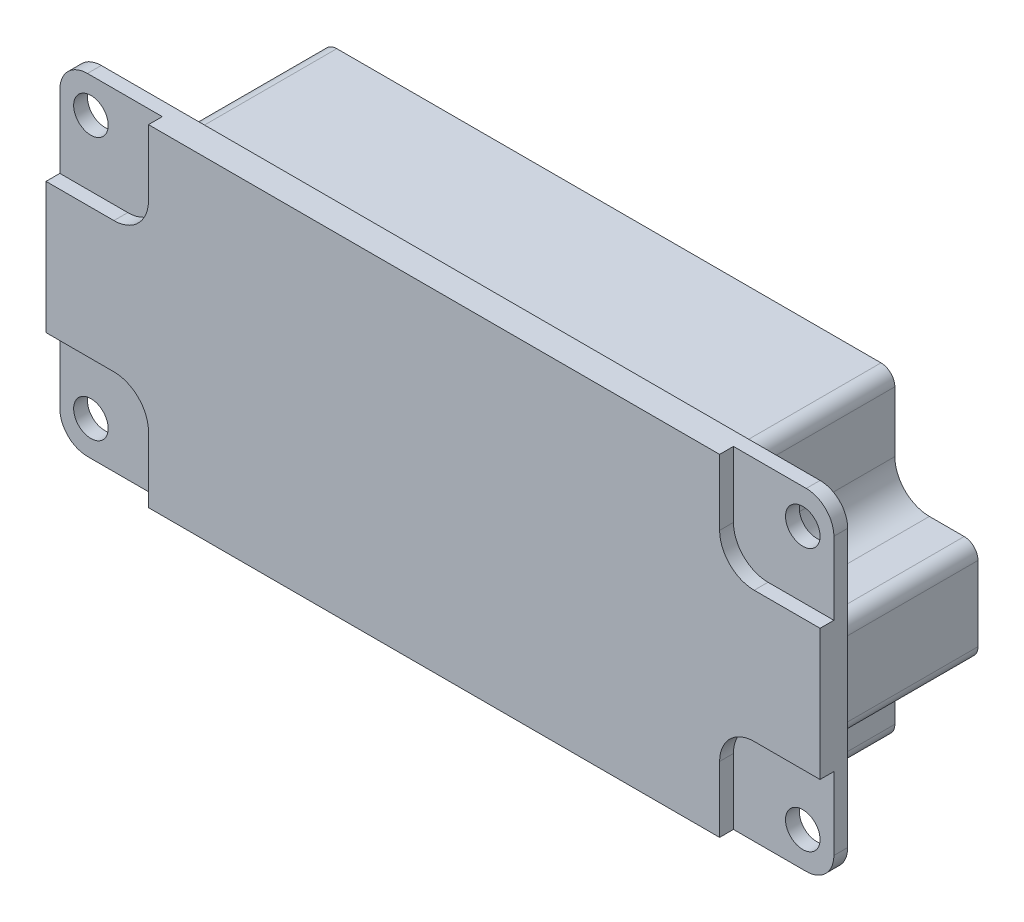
ISO-10303-21;
HEADER;
FILE_DESCRIPTION(('STEP AP214'),'2;1');
FILE_NAME('part.step','',(''),(''),'','','');
FILE_SCHEMA(('AUTOMOTIVE_DESIGN { 1 0 10303 214 1 1 1 1 }'));
ENDSEC;
DATA;
#1=APPLICATION_CONTEXT('core data for automotive mechanical design processes');
#2=APPLICATION_PROTOCOL_DEFINITION('international standard','automotive_design',2000,#1);
#3=PRODUCT_CONTEXT('',#1,'mechanical');
#4=PRODUCT('Part','Part','',(#3));
#5=PRODUCT_RELATED_PRODUCT_CATEGORY('part','',(#4));
#6=PRODUCT_DEFINITION_FORMATION('','',#4);
#7=PRODUCT_DEFINITION_CONTEXT('part definition',#1,'design');
#8=PRODUCT_DEFINITION('design','',#6,#7);
#9=PRODUCT_DEFINITION_SHAPE('','',#8);
#10=(LENGTH_UNIT() NAMED_UNIT(*) SI_UNIT(.MILLI.,.METRE.));
#11=(NAMED_UNIT(*) PLANE_ANGLE_UNIT() SI_UNIT($,.RADIAN.));
#12=(NAMED_UNIT(*) SI_UNIT($,.STERADIAN.) SOLID_ANGLE_UNIT());
#13=UNCERTAINTY_MEASURE_WITH_UNIT(LENGTH_MEASURE(1.E-05),#10,'distance_accuracy_value','');
#14=(GEOMETRIC_REPRESENTATION_CONTEXT(3) GLOBAL_UNCERTAINTY_ASSIGNED_CONTEXT((#13)) GLOBAL_UNIT_ASSIGNED_CONTEXT((#10,
#11,#12)) REPRESENTATION_CONTEXT('',''));
#15=CARTESIAN_POINT('',(0.,0.,0.));
#16=DIRECTION('',(0.,0.,1.));
#17=DIRECTION('',(1.,0.,0.));
#18=AXIS2_PLACEMENT_3D('',#15,#16,#17);
#19=CARTESIAN_POINT('',(33.02,-12.7,2.54));
#20=DIRECTION('',(0.,0.,-1.));
#21=DIRECTION('',(-1.,0.,0.));
#22=AXIS2_PLACEMENT_3D('',#19,#20,#21);
#23=CYLINDRICAL_SURFACE('',#22,2.54);
#24=CARTESIAN_POINT('',(33.02,-12.7,1.27));
#25=DIRECTION('',(0.,0.,1.));
#26=DIRECTION('',(1.,0.,0.));
#27=AXIS2_PLACEMENT_3D('',#24,#25,#26);
#28=CIRCLE('',#27,2.54);
#29=CARTESIAN_POINT('',(33.02,-15.24,1.27));
#30=VERTEX_POINT('',#29);
#31=CARTESIAN_POINT('',(35.56,-12.7,1.27));
#32=VERTEX_POINT('',#31);
#33=EDGE_CURVE('E475',#30,#32,#28,.T.);
#34=ORIENTED_EDGE('',*,*,#33,.F.);
#35=DIRECTION('',(0.,0.,-1.));
#36=VECTOR('',#35,1.);
#37=CARTESIAN_POINT('',(33.02,-15.24,2.54));
#38=LINE('',#37,#36);
#39=CARTESIAN_POINT('',(33.02,-15.24,0.));
#40=VERTEX_POINT('',#39);
#41=EDGE_CURVE('E43',#30,#40,#38,.T.);
#42=ORIENTED_EDGE('',*,*,#41,.T.);
#43=CARTESIAN_POINT('',(33.02,-12.7,0.));
#44=DIRECTION('',(0.,0.,1.));
#45=DIRECTION('',(1.,0.,0.));
#46=AXIS2_PLACEMENT_3D('',#43,#44,#45);
#47=CIRCLE('',#46,2.54);
#48=CARTESIAN_POINT('',(35.56,-12.7,0.));
#49=VERTEX_POINT('',#48);
#50=EDGE_CURVE('E692',#40,#49,#47,.T.);
#51=ORIENTED_EDGE('',*,*,#50,.T.);
#52=DIRECTION('',(0.,0.,-1.));
#53=VECTOR('',#52,1.);
#54=CARTESIAN_POINT('',(35.56,-12.7,2.54));
#55=LINE('',#54,#53);
#56=EDGE_CURVE('E718',#32,#49,#55,.T.);
#57=ORIENTED_EDGE('',*,*,#56,.F.);
#58=EDGE_LOOP('',(#34,#42,#51,#57));
#59=FACE_BOUND('',#58,.T.);
#60=ADVANCED_FACE('F34',(#59),#23,.T.);
#61=CARTESIAN_POINT('',(-33.02,12.7,2.54));
#62=DIRECTION('',(0.,0.,-1.));
#63=DIRECTION('',(-1.,0.,0.));
#64=AXIS2_PLACEMENT_3D('',#61,#62,#63);
#65=CYLINDRICAL_SURFACE('',#64,2.54);
#66=CARTESIAN_POINT('',(-33.02,12.7,1.27));
#67=DIRECTION('',(0.,0.,1.));
#68=DIRECTION('',(1.,0.,0.));
#69=AXIS2_PLACEMENT_3D('',#66,#67,#68);
#70=CIRCLE('',#69,2.54);
#71=CARTESIAN_POINT('',(-33.02,15.24,1.27));
#72=VERTEX_POINT('',#71);
#73=CARTESIAN_POINT('',(-35.56,12.7,1.27));
#74=VERTEX_POINT('',#73);
#75=EDGE_CURVE('E469',#72,#74,#70,.T.);
#76=ORIENTED_EDGE('',*,*,#75,.F.);
#77=DIRECTION('',(0.,0.,-1.));
#78=VECTOR('',#77,1.);
#79=CARTESIAN_POINT('',(-33.02,15.24,2.54));
#80=LINE('',#79,#78);
#81=CARTESIAN_POINT('',(-33.02,15.24,0.));
#82=VERTEX_POINT('',#81);
#83=EDGE_CURVE('E712',#72,#82,#80,.T.);
#84=ORIENTED_EDGE('',*,*,#83,.T.);
#85=CARTESIAN_POINT('',(-33.02,12.7,0.));
#86=DIRECTION('',(0.,0.,1.));
#87=DIRECTION('',(1.,0.,0.));
#88=AXIS2_PLACEMENT_3D('',#85,#86,#87);
#89=CIRCLE('',#88,2.54);
#90=CARTESIAN_POINT('',(-35.56,12.7,0.));
#91=VERTEX_POINT('',#90);
#92=EDGE_CURVE('E704',#82,#91,#89,.T.);
#93=ORIENTED_EDGE('',*,*,#92,.T.);
#94=DIRECTION('',(0.,0.,-1.));
#95=VECTOR('',#94,1.);
#96=CARTESIAN_POINT('',(-35.56,12.7,2.54));
#97=LINE('',#96,#95);
#98=EDGE_CURVE('E710',#74,#91,#97,.T.);
#99=ORIENTED_EDGE('',*,*,#98,.F.);
#100=EDGE_LOOP('',(#76,#84,#93,#99));
#101=FACE_BOUND('',#100,.T.);
#102=ADVANCED_FACE('F754',(#101),#65,.T.);
#103=CARTESIAN_POINT('',(32.7025,-12.065,-2.54));
#104=DIRECTION('',(0.,0.,1.));
#105=DIRECTION('',(1.,0.,0.));
#106=AXIS2_PLACEMENT_3D('',#103,#104,#105);
#107=CYLINDRICAL_SURFACE('',#106,1.5875);
#108=CARTESIAN_POINT('',(32.7025,-12.065,0.));
#109=DIRECTION('',(0.,0.,-1.));
#110=DIRECTION('',(-1.,0.,0.));
#111=AXIS2_PLACEMENT_3D('',#108,#109,#110);
#112=CIRCLE('',#111,1.5875);
#113=CARTESIAN_POINT('',(31.115,-12.065,0.));
#114=VERTEX_POINT('',#113);
#115=EDGE_CURVE('E477',#114,#114,#112,.T.);
#116=ORIENTED_EDGE('',*,*,#115,.T.);
#117=EDGE_LOOP('',(#116));
#118=FACE_BOUND('',#117,.T.);
#119=CARTESIAN_POINT('',(32.7025,-12.065,1.27));
#120=DIRECTION('',(0.,0.,1.));
#121=DIRECTION('',(1.,0.,0.));
#122=AXIS2_PLACEMENT_3D('',#119,#120,#121);
#123=CIRCLE('',#122,1.5875);
#124=CARTESIAN_POINT('',(34.29,-12.065,1.27));
#125=VERTEX_POINT('',#124);
#126=EDGE_CURVE('E38',#125,#125,#123,.F.);
#127=ORIENTED_EDGE('',*,*,#126,.F.);
#128=EDGE_LOOP('',(#127));
#129=FACE_BOUND('',#128,.T.);
#130=ADVANCED_FACE('F760',(#118,#129),#107,.F.);
#131=CARTESIAN_POINT('',(-32.7025,12.065,-2.54));
#132=DIRECTION('',(0.,0.,1.));
#133=DIRECTION('',(1.,0.,0.));
#134=AXIS2_PLACEMENT_3D('',#131,#132,#133);
#135=CYLINDRICAL_SURFACE('',#134,1.5875);
#136=CARTESIAN_POINT('',(-32.7025,12.065,0.));
#137=DIRECTION('',(0.,0.,-1.));
#138=DIRECTION('',(-1.,0.,0.));
#139=AXIS2_PLACEMENT_3D('',#136,#137,#138);
#140=CIRCLE('',#139,1.5875);
#141=CARTESIAN_POINT('',(-34.29,12.065,0.));
#142=VERTEX_POINT('',#141);
#143=EDGE_CURVE('E726',#142,#142,#140,.T.);
#144=ORIENTED_EDGE('',*,*,#143,.T.);
#145=EDGE_LOOP('',(#144));
#146=FACE_BOUND('',#145,.T.);
#147=CARTESIAN_POINT('',(-32.7025,12.065,1.27));
#148=DIRECTION('',(0.,0.,1.));
#149=DIRECTION('',(1.,0.,0.));
#150=AXIS2_PLACEMENT_3D('',#147,#148,#149);
#151=CIRCLE('',#150,1.5875);
#152=CARTESIAN_POINT('',(-31.115,12.065,1.27));
#153=VERTEX_POINT('',#152);
#154=EDGE_CURVE('E468',#153,#153,#151,.F.);
#155=ORIENTED_EDGE('',*,*,#154,.F.);
#156=EDGE_LOOP('',(#155));
#157=FACE_BOUND('',#156,.T.);
#158=ADVANCED_FACE('F776',(#146,#157),#135,.F.);
#159=CARTESIAN_POINT('',(-33.02,-12.7,2.54));
#160=DIRECTION('',(0.,0.,-1.));
#161=DIRECTION('',(-1.,0.,0.));
#162=AXIS2_PLACEMENT_3D('',#159,#160,#161);
#163=CYLINDRICAL_SURFACE('',#162,2.54);
#164=DIRECTION('',(0.,0.,-1.));
#165=VECTOR('',#164,1.);
#166=CARTESIAN_POINT('',(-33.02,-15.24,2.54));
#167=LINE('',#166,#165);
#168=CARTESIAN_POINT('',(-33.02,-15.24,1.27));
#169=VERTEX_POINT('',#168);
#170=CARTESIAN_POINT('',(-33.02,-15.24,0.));
#171=VERTEX_POINT('',#170);
#172=EDGE_CURVE('E11',#169,#171,#167,.T.);
#173=ORIENTED_EDGE('',*,*,#172,.F.);
#174=CARTESIAN_POINT('',(-33.02,-12.7,1.27));
#175=DIRECTION('',(0.,0.,-1.));
#176=DIRECTION('',(-1.,0.,0.));
#177=AXIS2_PLACEMENT_3D('',#174,#175,#176);
#178=CIRCLE('',#177,2.54);
#179=CARTESIAN_POINT('',(-35.56,-12.7,1.27));
#180=VERTEX_POINT('',#179);
#181=EDGE_CURVE('E465',#169,#180,#178,.T.);
#182=ORIENTED_EDGE('',*,*,#181,.T.);
#183=DIRECTION('',(0.,0.,-1.));
#184=VECTOR('',#183,1.);
#185=CARTESIAN_POINT('',(-35.56,-12.7,2.54));
#186=LINE('',#185,#184);
#187=CARTESIAN_POINT('',(-35.56,-12.7,0.));
#188=VERTEX_POINT('',#187);
#189=EDGE_CURVE('E686',#180,#188,#186,.T.);
#190=ORIENTED_EDGE('',*,*,#189,.T.);
#191=CARTESIAN_POINT('',(-33.02,-12.7,0.));
#192=DIRECTION('',(0.,0.,1.));
#193=DIRECTION('',(-1.,0.,0.));
#194=AXIS2_PLACEMENT_3D('',#191,#192,#193);
#195=CIRCLE('',#194,2.54);
#196=EDGE_CURVE('E672',#188,#171,#195,.T.);
#197=ORIENTED_EDGE('',*,*,#196,.T.);
#198=EDGE_LOOP('',(#173,#182,#190,#197));
#199=FACE_BOUND('',#198,.T.);
#200=ADVANCED_FACE('F36',(#199),#163,.T.);
#201=CARTESIAN_POINT('',(33.02,-15.24,2.54));
#202=DIRECTION('',(0.,1.,0.));
#203=DIRECTION('',(-1.,0.,0.));
#204=AXIS2_PLACEMENT_3D('',#201,#202,#203);
#205=PLANE('',#204);
#206=DIRECTION('',(1.,0.,0.));
#207=VECTOR('',#206,1.);
#208=CARTESIAN_POINT('',(35.56,-15.24,1.27));
#209=LINE('',#208,#207);
#210=CARTESIAN_POINT('',(26.3321014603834,-15.24,1.27));
#211=VERTEX_POINT('',#210);
#212=EDGE_CURVE('E388',#211,#30,#209,.T.);
#213=ORIENTED_EDGE('',*,*,#212,.F.);
#214=DIRECTION('',(0.,0.,1.));
#215=VECTOR('',#214,1.);
#216=CARTESIAN_POINT('',(26.3321014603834,-15.24,1.27));
#217=LINE('',#216,#215);
#218=CARTESIAN_POINT('',(26.3321014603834,-15.24,2.54));
#219=VERTEX_POINT('',#218);
#220=EDGE_CURVE('E399',#211,#219,#217,.T.);
#221=ORIENTED_EDGE('',*,*,#220,.T.);
#222=DIRECTION('',(1.,0.,0.));
#223=VECTOR('',#222,1.);
#224=CARTESIAN_POINT('',(33.02,-15.24,2.54));
#225=LINE('',#224,#223);
#226=CARTESIAN_POINT('',(-26.1442010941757,-15.24,2.54));
#227=VERTEX_POINT('',#226);
#228=EDGE_CURVE('E673',#227,#219,#225,.T.);
#229=ORIENTED_EDGE('',*,*,#228,.F.);
#230=DIRECTION('',(0.,0.,1.));
#231=VECTOR('',#230,1.);
#232=CARTESIAN_POINT('',(-26.1442010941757,-15.24,1.27));
#233=LINE('',#232,#231);
#234=CARTESIAN_POINT('',(-26.1442010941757,-15.24,1.27));
#235=VERTEX_POINT('',#234);
#236=EDGE_CURVE('E449',#235,#227,#233,.T.);
#237=ORIENTED_EDGE('',*,*,#236,.F.);
#238=DIRECTION('',(1.,0.,0.));
#239=VECTOR('',#238,1.);
#240=CARTESIAN_POINT('',(-35.56,-15.24,1.27));
#241=LINE('',#240,#239);
#242=EDGE_CURVE('E437',#169,#235,#241,.T.);
#243=ORIENTED_EDGE('',*,*,#242,.F.);
#244=ORIENTED_EDGE('',*,*,#172,.T.);
#245=DIRECTION('',(1.,0.,0.));
#246=VECTOR('',#245,1.);
#247=CARTESIAN_POINT('',(33.02,-15.24,0.));
#248=LINE('',#247,#246);
#249=EDGE_CURVE('E689',#171,#40,#248,.T.);
#250=ORIENTED_EDGE('',*,*,#249,.T.);
#251=ORIENTED_EDGE('',*,*,#41,.F.);
#252=EDGE_LOOP('',(#213,#221,#229,#237,#243,#244,#250,#251));
#253=FACE_BOUND('',#252,.T.);
#254=ADVANCED_FACE('F767',(#253),#205,.F.);
#255=CARTESIAN_POINT('',(35.56,-12.7,2.54));
#256=DIRECTION('',(-1.,0.,0.));
#257=DIRECTION('',(0.,0.,1.));
#258=AXIS2_PLACEMENT_3D('',#255,#256,#257);
#259=PLANE('',#258);
#260=DIRECTION('',(0.,1.,0.));
#261=VECTOR('',#260,1.);
#262=CARTESIAN_POINT('',(35.56,-12.7,2.54));
#263=LINE('',#262,#261);
#264=CARTESIAN_POINT('',(35.56,-6.0171354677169,2.54));
#265=VERTEX_POINT('',#264);
#266=CARTESIAN_POINT('',(35.56,6.0171354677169,2.54));
#267=VERTEX_POINT('',#266);
#268=EDGE_CURVE('E676',#265,#267,#263,.T.);
#269=ORIENTED_EDGE('',*,*,#268,.F.);
#270=DIRECTION('',(0.,0.,1.));
#271=VECTOR('',#270,1.);
#272=CARTESIAN_POINT('',(35.56,-6.0171354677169,1.27));
#273=LINE('',#272,#271);
#274=CARTESIAN_POINT('',(35.56,-6.0171354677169,1.27));
#275=VERTEX_POINT('',#274);
#276=EDGE_CURVE('E390',#275,#265,#273,.T.);
#277=ORIENTED_EDGE('',*,*,#276,.F.);
#278=DIRECTION('',(0.,1.,0.));
#279=VECTOR('',#278,1.);
#280=CARTESIAN_POINT('',(35.56,-6.0171354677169,1.27));
#281=LINE('',#280,#279);
#282=EDGE_CURVE('E376',#32,#275,#281,.T.);
#283=ORIENTED_EDGE('',*,*,#282,.F.);
#284=ORIENTED_EDGE('',*,*,#56,.T.);
#285=DIRECTION('',(0.,1.,0.));
#286=VECTOR('',#285,1.);
#287=CARTESIAN_POINT('',(35.56,-12.7,0.));
#288=LINE('',#287,#286);
#289=CARTESIAN_POINT('',(35.56,12.7,0.));
#290=VERTEX_POINT('',#289);
#291=EDGE_CURVE('E695',#49,#290,#288,.T.);
#292=ORIENTED_EDGE('',*,*,#291,.T.);
#293=DIRECTION('',(0.,0.,-1.));
#294=VECTOR('',#293,1.);
#295=CARTESIAN_POINT('',(35.56,12.7,2.54));
#296=LINE('',#295,#294);
#297=CARTESIAN_POINT('',(35.56,12.7,1.27));
#298=VERTEX_POINT('',#297);
#299=EDGE_CURVE('E716',#298,#290,#296,.T.);
#300=ORIENTED_EDGE('',*,*,#299,.F.);
#301=DIRECTION('',(0.,1.,0.));
#302=VECTOR('',#301,1.);
#303=CARTESIAN_POINT('',(35.56,6.0171354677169,1.27));
#304=LINE('',#303,#302);
#305=CARTESIAN_POINT('',(35.56,6.0171354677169,1.27));
#306=VERTEX_POINT('',#305);
#307=EDGE_CURVE('E355',#306,#298,#304,.T.);
#308=ORIENTED_EDGE('',*,*,#307,.F.);
#309=DIRECTION('',(0.,0.,1.));
#310=VECTOR('',#309,1.);
#311=CARTESIAN_POINT('',(35.56,6.0171354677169,1.27));
#312=LINE('',#311,#310);
#313=EDGE_CURVE('E346',#306,#267,#312,.T.);
#314=ORIENTED_EDGE('',*,*,#313,.T.);
#315=EDGE_LOOP('',(#269,#277,#283,#284,#292,#300,#308,#314));
#316=FACE_BOUND('',#315,.T.);
#317=ADVANCED_FACE('F765',(#316),#259,.F.);
#318=CARTESIAN_POINT('',(33.02,12.7,2.54));
#319=DIRECTION('',(0.,0.,-1.));
#320=DIRECTION('',(-1.,0.,0.));
#321=AXIS2_PLACEMENT_3D('',#318,#319,#320);
#322=CYLINDRICAL_SURFACE('',#321,2.54);
#323=DIRECTION('',(0.,0.,-1.));
#324=VECTOR('',#323,1.);
#325=CARTESIAN_POINT('',(33.02,15.24,2.54));
#326=LINE('',#325,#324);
#327=CARTESIAN_POINT('',(33.02,15.24,1.27));
#328=VERTEX_POINT('',#327);
#329=CARTESIAN_POINT('',(33.02,15.24,0.));
#330=VERTEX_POINT('',#329);
#331=EDGE_CURVE('E714',#328,#330,#326,.T.);
#332=ORIENTED_EDGE('',*,*,#331,.F.);
#333=CARTESIAN_POINT('',(33.02,12.7,1.27));
#334=DIRECTION('',(0.,0.,-1.));
#335=DIRECTION('',(-1.,0.,0.));
#336=AXIS2_PLACEMENT_3D('',#333,#334,#335);
#337=CIRCLE('',#336,2.54);
#338=EDGE_CURVE('E472',#328,#298,#337,.T.);
#339=ORIENTED_EDGE('',*,*,#338,.T.);
#340=ORIENTED_EDGE('',*,*,#299,.T.);
#341=CARTESIAN_POINT('',(33.02,12.7,0.));
#342=DIRECTION('',(0.,0.,1.));
#343=DIRECTION('',(1.,0.,0.));
#344=AXIS2_PLACEMENT_3D('',#341,#342,#343);
#345=CIRCLE('',#344,2.54);
#346=EDGE_CURVE('E698',#290,#330,#345,.T.);
#347=ORIENTED_EDGE('',*,*,#346,.T.);
#348=EDGE_LOOP('',(#332,#339,#340,#347));
#349=FACE_BOUND('',#348,.T.);
#350=ADVANCED_FACE('F774',(#349),#322,.T.);
#351=CARTESIAN_POINT('',(33.02,15.24,2.54));
#352=DIRECTION('',(0.,-1.,0.));
#353=DIRECTION('',(1.,0.,0.));
#354=AXIS2_PLACEMENT_3D('',#351,#352,#353);
#355=PLANE('',#354);
#356=DIRECTION('',(-1.,0.,0.));
#357=VECTOR('',#356,1.);
#358=CARTESIAN_POINT('',(-35.56,15.24,1.27));
#359=LINE('',#358,#357);
#360=CARTESIAN_POINT('',(-26.1442010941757,15.24,1.27));
#361=VERTEX_POINT('',#360);
#362=EDGE_CURVE('E415',#361,#72,#359,.T.);
#363=ORIENTED_EDGE('',*,*,#362,.F.);
#364=DIRECTION('',(0.,0.,1.));
#365=VECTOR('',#364,1.);
#366=CARTESIAN_POINT('',(-26.1442010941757,15.24,1.27));
#367=LINE('',#366,#365);
#368=CARTESIAN_POINT('',(-26.1442010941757,15.24,2.54));
#369=VERTEX_POINT('',#368);
#370=EDGE_CURVE('E431',#361,#369,#367,.T.);
#371=ORIENTED_EDGE('',*,*,#370,.T.);
#372=DIRECTION('',(-1.,0.,0.));
#373=VECTOR('',#372,1.);
#374=CARTESIAN_POINT('',(33.02,15.24,2.54));
#375=LINE('',#374,#373);
#376=CARTESIAN_POINT('',(26.3321014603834,15.24,2.54));
#377=VERTEX_POINT('',#376);
#378=EDGE_CURVE('E680',#377,#369,#375,.T.);
#379=ORIENTED_EDGE('',*,*,#378,.F.);
#380=DIRECTION('',(0.,0.,1.));
#381=VECTOR('',#380,1.);
#382=CARTESIAN_POINT('',(26.3321014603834,15.24,1.27));
#383=LINE('',#382,#381);
#384=CARTESIAN_POINT('',(26.3321014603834,15.24,1.27));
#385=VERTEX_POINT('',#384);
#386=EDGE_CURVE('E373',#385,#377,#383,.T.);
#387=ORIENTED_EDGE('',*,*,#386,.F.);
#388=DIRECTION('',(-1.,0.,0.));
#389=VECTOR('',#388,1.);
#390=CARTESIAN_POINT('',(35.56,15.24,1.27));
#391=LINE('',#390,#389);
#392=EDGE_CURVE('E366',#328,#385,#391,.T.);
#393=ORIENTED_EDGE('',*,*,#392,.F.);
#394=ORIENTED_EDGE('',*,*,#331,.T.);
#395=DIRECTION('',(-1.,0.,0.));
#396=VECTOR('',#395,1.);
#397=CARTESIAN_POINT('',(33.02,15.24,0.));
#398=LINE('',#397,#396);
#399=EDGE_CURVE('E701',#330,#82,#398,.T.);
#400=ORIENTED_EDGE('',*,*,#399,.T.);
#401=ORIENTED_EDGE('',*,*,#83,.F.);
#402=EDGE_LOOP('',(#363,#371,#379,#387,#393,#394,#400,#401));
#403=FACE_BOUND('',#402,.T.);
#404=ADVANCED_FACE('F837',(#403),#355,.F.);
#405=CARTESIAN_POINT('',(-35.56,-12.7,2.54));
#406=DIRECTION('',(1.,0.,0.));
#407=DIRECTION('',(0.,0.,-1.));
#408=AXIS2_PLACEMENT_3D('',#405,#406,#407);
#409=PLANE('',#408);
#410=DIRECTION('',(0.,-1.,0.));
#411=VECTOR('',#410,1.);
#412=CARTESIAN_POINT('',(-35.56,-12.7,2.54));
#413=LINE('',#412,#411);
#414=CARTESIAN_POINT('',(-35.56,6.0171354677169,2.54));
#415=VERTEX_POINT('',#414);
#416=CARTESIAN_POINT('',(-35.56,-6.0171354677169,2.54));
#417=VERTEX_POINT('',#416);
#418=EDGE_CURVE('E683',#415,#417,#413,.T.);
#419=ORIENTED_EDGE('',*,*,#418,.F.);
#420=DIRECTION('',(0.,0.,1.));
#421=VECTOR('',#420,1.);
#422=CARTESIAN_POINT('',(-35.56,6.0171354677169,1.27));
#423=LINE('',#422,#421);
#424=CARTESIAN_POINT('',(-35.56,6.0171354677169,1.27));
#425=VERTEX_POINT('',#424);
#426=EDGE_CURVE('E429',#425,#415,#423,.T.);
#427=ORIENTED_EDGE('',*,*,#426,.F.);
#428=DIRECTION('',(0.,-1.,0.));
#429=VECTOR('',#428,1.);
#430=CARTESIAN_POINT('',(-35.56,6.0171354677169,1.27));
#431=LINE('',#430,#429);
#432=EDGE_CURVE('E417',#74,#425,#431,.T.);
#433=ORIENTED_EDGE('',*,*,#432,.F.);
#434=ORIENTED_EDGE('',*,*,#98,.T.);
#435=DIRECTION('',(0.,-1.,0.));
#436=VECTOR('',#435,1.);
#437=CARTESIAN_POINT('',(-35.56,-12.7,0.));
#438=LINE('',#437,#436);
#439=EDGE_CURVE('E677',#91,#188,#438,.T.);
#440=ORIENTED_EDGE('',*,*,#439,.T.);
#441=ORIENTED_EDGE('',*,*,#189,.F.);
#442=DIRECTION('',(0.,-1.,0.));
#443=VECTOR('',#442,1.);
#444=CARTESIAN_POINT('',(-35.56,-6.0171354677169,1.27));
#445=LINE('',#444,#443);
#446=CARTESIAN_POINT('',(-35.56,-6.0171354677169,1.27));
#447=VERTEX_POINT('',#446);
#448=EDGE_CURVE('E435',#447,#180,#445,.T.);
#449=ORIENTED_EDGE('',*,*,#448,.F.);
#450=DIRECTION('',(0.,0.,1.));
#451=VECTOR('',#450,1.);
#452=CARTESIAN_POINT('',(-35.56,-6.0171354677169,1.27));
#453=LINE('',#452,#451);
#454=EDGE_CURVE('E456',#447,#417,#453,.T.);
#455=ORIENTED_EDGE('',*,*,#454,.T.);
#456=EDGE_LOOP('',(#419,#427,#433,#434,#440,#441,#449,#455));
#457=FACE_BOUND('',#456,.T.);
#458=ADVANCED_FACE('F821',(#457),#409,.F.);
#459=CARTESIAN_POINT('',(-33.02,-12.7,2.54));
#460=DIRECTION('',(0.,0.,-1.));
#461=DIRECTION('',(-1.,0.,0.));
#462=AXIS2_PLACEMENT_3D('',#459,#460,#461);
#463=PLANE('',#462);
#464=ORIENTED_EDGE('',*,*,#228,.T.);
#465=DIRECTION('',(0.,-1.,0.));
#466=VECTOR('',#465,1.);
#467=CARTESIAN_POINT('',(26.3321014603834,-9.19213546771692,2.54));
#468=LINE('',#467,#466);
#469=CARTESIAN_POINT('',(26.3321014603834,-9.19213546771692,2.54));
#470=VERTEX_POINT('',#469);
#471=EDGE_CURVE('E379',#470,#219,#468,.T.);
#472=ORIENTED_EDGE('',*,*,#471,.F.);
#473=CARTESIAN_POINT('',(29.5071014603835,-9.1921354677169,2.54));
#474=DIRECTION('',(0.,0.,1.));
#475=DIRECTION('',(1.,0.,0.));
#476=AXIS2_PLACEMENT_3D('',#473,#474,#475);
#477=CIRCLE('',#476,3.175);
#478=CARTESIAN_POINT('',(29.5071014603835,-6.0171354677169,2.54));
#479=VERTEX_POINT('',#478);
#480=EDGE_CURVE('E394',#479,#470,#477,.T.);
#481=ORIENTED_EDGE('',*,*,#480,.F.);
#482=DIRECTION('',(-1.,0.,0.));
#483=VECTOR('',#482,1.);
#484=CARTESIAN_POINT('',(35.56,-6.0171354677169,2.54));
#485=LINE('',#484,#483);
#486=EDGE_CURVE('E391',#265,#479,#485,.T.);
#487=ORIENTED_EDGE('',*,*,#486,.F.);
#488=ORIENTED_EDGE('',*,*,#268,.T.);
#489=DIRECTION('',(1.,0.,0.));
#490=VECTOR('',#489,1.);
#491=CARTESIAN_POINT('',(35.56,6.0171354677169,2.54));
#492=LINE('',#491,#490);
#493=CARTESIAN_POINT('',(29.5071014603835,6.0171354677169,2.54));
#494=VERTEX_POINT('',#493);
#495=EDGE_CURVE('E362',#494,#267,#492,.T.);
#496=ORIENTED_EDGE('',*,*,#495,.F.);
#497=CARTESIAN_POINT('',(29.5071014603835,9.1921354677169,2.54));
#498=DIRECTION('',(0.,0.,1.));
#499=DIRECTION('',(-1.,0.,0.));
#500=AXIS2_PLACEMENT_3D('',#497,#498,#499);
#501=CIRCLE('',#500,3.175);
#502=CARTESIAN_POINT('',(26.3321014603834,9.19213546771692,2.54));
#503=VERTEX_POINT('',#502);
#504=EDGE_CURVE('E59',#503,#494,#501,.T.);
#505=ORIENTED_EDGE('',*,*,#504,.F.);
#506=DIRECTION('',(0.,-1.,0.));
#507=VECTOR('',#506,1.);
#508=CARTESIAN_POINT('',(26.3321014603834,9.19213546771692,2.54));
#509=LINE('',#508,#507);
#510=EDGE_CURVE('E359',#377,#503,#509,.T.);
#511=ORIENTED_EDGE('',*,*,#510,.F.);
#512=ORIENTED_EDGE('',*,*,#378,.T.);
#513=DIRECTION('',(0.,1.,0.));
#514=VECTOR('',#513,1.);
#515=CARTESIAN_POINT('',(-26.1442010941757,9.19213546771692,2.54));
#516=LINE('',#515,#514);
#517=CARTESIAN_POINT('',(-26.1442010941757,9.19213546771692,2.54));
#518=VERTEX_POINT('',#517);
#519=EDGE_CURVE('E424',#518,#369,#516,.T.);
#520=ORIENTED_EDGE('',*,*,#519,.F.);
#521=CARTESIAN_POINT('',(-29.3192010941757,9.1921354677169,2.54));
#522=DIRECTION('',(0.,0.,1.));
#523=DIRECTION('',(1.,0.,0.));
#524=AXIS2_PLACEMENT_3D('',#521,#522,#523);
#525=CIRCLE('',#524,3.175);
#526=CARTESIAN_POINT('',(-29.3192010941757,6.0171354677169,2.54));
#527=VERTEX_POINT('',#526);
#528=EDGE_CURVE('E51',#527,#518,#525,.T.);
#529=ORIENTED_EDGE('',*,*,#528,.F.);
#530=DIRECTION('',(1.,0.,0.));
#531=VECTOR('',#530,1.);
#532=CARTESIAN_POINT('',(-35.56,6.0171354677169,2.54));
#533=LINE('',#532,#531);
#534=EDGE_CURVE('E412',#415,#527,#533,.T.);
#535=ORIENTED_EDGE('',*,*,#534,.F.);
#536=ORIENTED_EDGE('',*,*,#418,.T.);
#537=DIRECTION('',(-1.,0.,0.));
#538=VECTOR('',#537,1.);
#539=CARTESIAN_POINT('',(-35.56,-6.0171354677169,2.54));
#540=LINE('',#539,#538);
#541=CARTESIAN_POINT('',(-29.3192010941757,-6.0171354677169,2.54));
#542=VERTEX_POINT('',#541);
#543=EDGE_CURVE('E438',#542,#417,#540,.T.);
#544=ORIENTED_EDGE('',*,*,#543,.F.);
#545=CARTESIAN_POINT('',(-29.3192010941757,-9.1921354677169,2.54));
#546=DIRECTION('',(0.,0.,1.));
#547=DIRECTION('',(-1.,0.,0.));
#548=AXIS2_PLACEMENT_3D('',#545,#546,#547);
#549=CIRCLE('',#548,3.175);
#550=CARTESIAN_POINT('',(-26.1442010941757,-9.19213546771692,2.54));
#551=VERTEX_POINT('',#550);
#552=EDGE_CURVE('E452',#551,#542,#549,.T.);
#553=ORIENTED_EDGE('',*,*,#552,.F.);
#554=DIRECTION('',(0.,1.,0.));
#555=VECTOR('',#554,1.);
#556=CARTESIAN_POINT('',(-26.1442010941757,-9.19213546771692,2.54));
#557=LINE('',#556,#555);
#558=EDGE_CURVE('E402',#227,#551,#557,.T.);
#559=ORIENTED_EDGE('',*,*,#558,.F.);
#560=EDGE_LOOP('',(#464,#472,#481,#487,#488,#496,#505,#511,#512,#520,#529,#535,#536,#544,#553,#559));
#561=FACE_BOUND('',#560,.T.);
#562=ADVANCED_FACE('F804',(#561),#463,.F.);
#563=CARTESIAN_POINT('',(-33.02,-12.7,0.));
#564=DIRECTION('',(0.,0.,-1.));
#565=DIRECTION('',(-1.,0.,0.));
#566=AXIS2_PLACEMENT_3D('',#563,#564,#565);
#567=PLANE('',#566);
#568=CARTESIAN_POINT('',(-32.7025,-12.065,0.));
#569=DIRECTION('',(0.,0.,-1.));
#570=DIRECTION('',(-1.,0.,0.));
#571=AXIS2_PLACEMENT_3D('',#568,#569,#570);
#572=CIRCLE('',#571,1.5875);
#573=CARTESIAN_POINT('',(-34.29,-12.065,0.));
#574=VERTEX_POINT('',#573);
#575=EDGE_CURVE('E533',#574,#574,#572,.T.);
#576=ORIENTED_EDGE('',*,*,#575,.F.);
#577=EDGE_LOOP('',(#576));
#578=FACE_BOUND('',#577,.T.);
#579=ORIENTED_EDGE('',*,*,#143,.F.);
#580=EDGE_LOOP('',(#579));
#581=FACE_BOUND('',#580,.T.);
#582=CARTESIAN_POINT('',(32.7025,12.065,0.));
#583=DIRECTION('',(0.,0.,-1.));
#584=DIRECTION('',(-1.,0.,0.));
#585=AXIS2_PLACEMENT_3D('',#582,#583,#584);
#586=CIRCLE('',#585,1.5875);
#587=CARTESIAN_POINT('',(31.115,12.065,0.));
#588=VERTEX_POINT('',#587);
#589=EDGE_CURVE('E723',#588,#588,#586,.T.);
#590=ORIENTED_EDGE('',*,*,#589,.F.);
#591=EDGE_LOOP('',(#590));
#592=FACE_BOUND('',#591,.T.);
#593=ORIENTED_EDGE('',*,*,#115,.F.);
#594=EDGE_LOOP('',(#593));
#595=FACE_BOUND('',#594,.T.);
#596=CARTESIAN_POINT('',(30.3656381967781,-7.87444363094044,0.));
#597=DIRECTION('',(0.,0.,1.));
#598=DIRECTION('',(1.,0.,0.));
#599=AXIS2_PLACEMENT_3D('',#596,#597,#598);
#600=CIRCLE('',#599,3.175);
#601=CARTESIAN_POINT('',(30.3656381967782,-4.69944363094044,0.));
#602=VERTEX_POINT('',#601);
#603=CARTESIAN_POINT('',(27.1906381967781,-7.87444363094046,0.));
#604=VERTEX_POINT('',#603);
#605=EDGE_CURVE('E529',#602,#604,#600,.T.);
#606=ORIENTED_EDGE('',*,*,#605,.F.);
#607=DIRECTION('',(-1.,0.,0.));
#608=VECTOR('',#607,1.);
#609=CARTESIAN_POINT('',(33.5611929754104,-4.69944363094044,0.));
#610=LINE('',#609,#608);
#611=CARTESIAN_POINT('',(33.5611929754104,-4.69944363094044,0.));
#612=VERTEX_POINT('',#611);
#613=EDGE_CURVE('E482',#612,#602,#610,.T.);
#614=ORIENTED_EDGE('',*,*,#613,.F.);
#615=CARTESIAN_POINT('',(33.5611929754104,-3.42944363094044,0.));
#616=DIRECTION('',(0.,0.,-1.));
#617=DIRECTION('',(-1.,0.,0.));
#618=AXIS2_PLACEMENT_3D('',#615,#616,#617);
#619=CIRCLE('',#618,1.27);
#620=CARTESIAN_POINT('',(34.8311929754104,-3.42944363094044,0.));
#621=VERTEX_POINT('',#620);
#622=EDGE_CURVE('E596',#621,#612,#619,.T.);
#623=ORIENTED_EDGE('',*,*,#622,.F.);
#624=DIRECTION('',(0.,-1.,0.));
#625=VECTOR('',#624,1.);
#626=CARTESIAN_POINT('',(34.8311929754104,3.42944363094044,0.));
#627=LINE('',#626,#625);
#628=CARTESIAN_POINT('',(34.8311929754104,3.42944363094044,0.));
#629=VERTEX_POINT('',#628);
#630=EDGE_CURVE('E593',#629,#621,#627,.T.);
#631=ORIENTED_EDGE('',*,*,#630,.F.);
#632=CARTESIAN_POINT('',(33.5611929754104,3.42944363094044,0.));
#633=DIRECTION('',(0.,0.,-1.));
#634=DIRECTION('',(1.,0.,0.));
#635=AXIS2_PLACEMENT_3D('',#632,#633,#634);
#636=CIRCLE('',#635,1.27);
#637=CARTESIAN_POINT('',(33.5611929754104,4.69944363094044,0.));
#638=VERTEX_POINT('',#637);
#639=EDGE_CURVE('E590',#638,#629,#636,.T.);
#640=ORIENTED_EDGE('',*,*,#639,.F.);
#641=DIRECTION('',(1.,0.,0.));
#642=VECTOR('',#641,1.);
#643=CARTESIAN_POINT('',(33.5611929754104,4.69944363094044,0.));
#644=LINE('',#643,#642);
#645=CARTESIAN_POINT('',(30.3656381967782,4.69944363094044,0.));
#646=VERTEX_POINT('',#645);
#647=EDGE_CURVE('E587',#646,#638,#644,.T.);
#648=ORIENTED_EDGE('',*,*,#647,.F.);
#649=CARTESIAN_POINT('',(30.3656381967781,7.87444363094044,0.));
#650=DIRECTION('',(0.,0.,1.));
#651=DIRECTION('',(-1.,0.,0.));
#652=AXIS2_PLACEMENT_3D('',#649,#650,#651);
#653=CIRCLE('',#652,3.175);
#654=CARTESIAN_POINT('',(27.1906381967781,7.87444363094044,0.));
#655=VERTEX_POINT('',#654);
#656=EDGE_CURVE('E584',#655,#646,#653,.T.);
#657=ORIENTED_EDGE('',*,*,#656,.F.);
#658=DIRECTION('',(0.,-1.,0.));
#659=VECTOR('',#658,1.);
#660=CARTESIAN_POINT('',(27.1906381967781,7.87444363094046,0.));
#661=LINE('',#660,#659);
#662=CARTESIAN_POINT('',(27.1906381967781,13.4269496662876,0.));
#663=VERTEX_POINT('',#662);
#664=EDGE_CURVE('E581',#663,#655,#661,.T.);
#665=ORIENTED_EDGE('',*,*,#664,.F.);
#666=CARTESIAN_POINT('',(25.9206381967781,13.4269496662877,0.));
#667=DIRECTION('',(0.,0.,-1.));
#668=DIRECTION('',(1.,0.,0.));
#669=AXIS2_PLACEMENT_3D('',#666,#667,#668);
#670=CIRCLE('',#669,1.27);
#671=CARTESIAN_POINT('',(25.9206381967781,14.6969496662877,0.));
#672=VERTEX_POINT('',#671);
#673=EDGE_CURVE('E578',#672,#663,#670,.T.);
#674=ORIENTED_EDGE('',*,*,#673,.F.);
#675=DIRECTION('',(1.,0.,0.));
#676=VECTOR('',#675,1.);
#677=CARTESIAN_POINT('',(25.9206381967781,14.6969496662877,0.));
#678=LINE('',#677,#676);
#679=CARTESIAN_POINT('',(-24.081493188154,14.6969496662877,0.));
#680=VERTEX_POINT('',#679);
#681=EDGE_CURVE('E575',#680,#672,#678,.T.);
#682=ORIENTED_EDGE('',*,*,#681,.F.);
#683=CARTESIAN_POINT('',(-24.081493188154,13.4269496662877,0.));
#684=DIRECTION('',(0.,0.,-1.));
#685=DIRECTION('',(-1.,0.,0.));
#686=AXIS2_PLACEMENT_3D('',#683,#684,#685);
#687=CIRCLE('',#686,1.27);
#688=CARTESIAN_POINT('',(-25.351493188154,13.4269496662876,0.));
#689=VERTEX_POINT('',#688);
#690=EDGE_CURVE('E572',#689,#680,#687,.T.);
#691=ORIENTED_EDGE('',*,*,#690,.F.);
#692=DIRECTION('',(0.,1.,0.));
#693=VECTOR('',#692,1.);
#694=CARTESIAN_POINT('',(-25.351493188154,7.87444363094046,0.));
#695=LINE('',#694,#693);
#696=CARTESIAN_POINT('',(-25.351493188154,7.87444363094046,0.));
#697=VERTEX_POINT('',#696);
#698=EDGE_CURVE('E569',#697,#689,#695,.T.);
#699=ORIENTED_EDGE('',*,*,#698,.F.);
#700=CARTESIAN_POINT('',(-28.526493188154,7.87444363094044,0.));
#701=DIRECTION('',(0.,0.,1.));
#702=DIRECTION('',(1.,0.,0.));
#703=AXIS2_PLACEMENT_3D('',#700,#701,#702);
#704=CIRCLE('',#703,3.175);
#705=CARTESIAN_POINT('',(-28.526493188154,4.69944363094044,0.));
#706=VERTEX_POINT('',#705);
#707=EDGE_CURVE('E566',#706,#697,#704,.T.);
#708=ORIENTED_EDGE('',*,*,#707,.F.);
#709=DIRECTION('',(1.,0.,0.));
#710=VECTOR('',#709,1.);
#711=CARTESIAN_POINT('',(-31.7220479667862,4.69944363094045,0.));
#712=LINE('',#711,#710);
#713=CARTESIAN_POINT('',(-31.7220479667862,4.69944363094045,0.));
#714=VERTEX_POINT('',#713);
#715=EDGE_CURVE('E563',#714,#706,#712,.T.);
#716=ORIENTED_EDGE('',*,*,#715,.F.);
#717=CARTESIAN_POINT('',(-31.7220479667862,3.42944363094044,0.));
#718=DIRECTION('',(0.,0.,-1.));
#719=DIRECTION('',(-1.,0.,0.));
#720=AXIS2_PLACEMENT_3D('',#717,#718,#719);
#721=CIRCLE('',#720,1.27);
#722=CARTESIAN_POINT('',(-32.9920479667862,3.42944363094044,0.));
#723=VERTEX_POINT('',#722);
#724=EDGE_CURVE('E560',#723,#714,#721,.T.);
#725=ORIENTED_EDGE('',*,*,#724,.F.);
#726=DIRECTION('',(0.,1.,0.));
#727=VECTOR('',#726,1.);
#728=CARTESIAN_POINT('',(-32.9920479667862,3.42944363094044,0.));
#729=LINE('',#728,#727);
#730=CARTESIAN_POINT('',(-32.9920479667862,-3.42944363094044,0.));
#731=VERTEX_POINT('',#730);
#732=EDGE_CURVE('E557',#731,#723,#729,.T.);
#733=ORIENTED_EDGE('',*,*,#732,.F.);
#734=CARTESIAN_POINT('',(-31.7220479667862,-3.42944363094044,0.));
#735=DIRECTION('',(0.,0.,-1.));
#736=DIRECTION('',(1.,0.,0.));
#737=AXIS2_PLACEMENT_3D('',#734,#735,#736);
#738=CIRCLE('',#737,1.27);
#739=CARTESIAN_POINT('',(-31.7220479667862,-4.69944363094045,0.));
#740=VERTEX_POINT('',#739);
#741=EDGE_CURVE('E554',#740,#731,#738,.T.);
#742=ORIENTED_EDGE('',*,*,#741,.F.);
#743=DIRECTION('',(-1.,0.,0.));
#744=VECTOR('',#743,1.);
#745=CARTESIAN_POINT('',(-31.7220479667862,-4.69944363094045,0.));
#746=LINE('',#745,#744);
#747=CARTESIAN_POINT('',(-28.526493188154,-4.69944363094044,0.));
#748=VERTEX_POINT('',#747);
#749=EDGE_CURVE('E551',#748,#740,#746,.T.);
#750=ORIENTED_EDGE('',*,*,#749,.F.);
#751=CARTESIAN_POINT('',(-28.526493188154,-7.87444363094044,0.));
#752=DIRECTION('',(0.,0.,1.));
#753=DIRECTION('',(-1.,0.,0.));
#754=AXIS2_PLACEMENT_3D('',#751,#752,#753);
#755=CIRCLE('',#754,3.175);
#756=CARTESIAN_POINT('',(-25.351493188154,-7.87444363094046,0.));
#757=VERTEX_POINT('',#756);
#758=EDGE_CURVE('E548',#757,#748,#755,.T.);
#759=ORIENTED_EDGE('',*,*,#758,.F.);
#760=DIRECTION('',(0.,1.,0.));
#761=VECTOR('',#760,1.);
#762=CARTESIAN_POINT('',(-25.351493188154,-7.87444363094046,0.));
#763=LINE('',#762,#761);
#764=CARTESIAN_POINT('',(-25.351493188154,-13.4269496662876,0.));
#765=VERTEX_POINT('',#764);
#766=EDGE_CURVE('E545',#765,#757,#763,.T.);
#767=ORIENTED_EDGE('',*,*,#766,.F.);
#768=CARTESIAN_POINT('',(-24.081493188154,-13.4269496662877,0.));
#769=DIRECTION('',(0.,0.,-1.));
#770=DIRECTION('',(1.,0.,0.));
#771=AXIS2_PLACEMENT_3D('',#768,#769,#770);
#772=CIRCLE('',#771,1.27);
#773=CARTESIAN_POINT('',(-24.081493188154,-14.6969496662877,0.));
#774=VERTEX_POINT('',#773);
#775=EDGE_CURVE('E542',#774,#765,#772,.T.);
#776=ORIENTED_EDGE('',*,*,#775,.F.);
#777=DIRECTION('',(-1.,0.,0.));
#778=VECTOR('',#777,1.);
#779=CARTESIAN_POINT('',(25.9206381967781,-14.6969496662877,0.));
#780=LINE('',#779,#778);
#781=CARTESIAN_POINT('',(25.9206381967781,-14.6969496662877,0.));
#782=VERTEX_POINT('',#781);
#783=EDGE_CURVE('E539',#782,#774,#780,.T.);
#784=ORIENTED_EDGE('',*,*,#783,.F.);
#785=CARTESIAN_POINT('',(25.9206381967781,-13.4269496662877,0.));
#786=DIRECTION('',(0.,0.,-1.));
#787=DIRECTION('',(-1.,0.,0.));
#788=AXIS2_PLACEMENT_3D('',#785,#786,#787);
#789=CIRCLE('',#788,1.27);
#790=CARTESIAN_POINT('',(27.1906381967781,-13.4269496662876,0.));
#791=VERTEX_POINT('',#790);
#792=EDGE_CURVE('E536',#791,#782,#789,.T.);
#793=ORIENTED_EDGE('',*,*,#792,.F.);
#794=DIRECTION('',(0.,-1.,0.));
#795=VECTOR('',#794,1.);
#796=CARTESIAN_POINT('',(27.1906381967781,-7.87444363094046,0.));
#797=LINE('',#796,#795);
#798=EDGE_CURVE('E532',#604,#791,#797,.T.);
#799=ORIENTED_EDGE('',*,*,#798,.F.);
#800=EDGE_LOOP('',(#606,#614,#623,#631,#640,#648,#657,#665,#674,#682,#691,#699,#708,#716,#725,
#733,#742,#750,#759,#767,#776,#784,#793,#799));
#801=FACE_BOUND('',#800,.T.);
#802=ORIENTED_EDGE('',*,*,#196,.F.);
#803=ORIENTED_EDGE('',*,*,#439,.F.);
#804=ORIENTED_EDGE('',*,*,#92,.F.);
#805=ORIENTED_EDGE('',*,*,#399,.F.);
#806=ORIENTED_EDGE('',*,*,#346,.F.);
#807=ORIENTED_EDGE('',*,*,#291,.F.);
#808=ORIENTED_EDGE('',*,*,#50,.F.);
#809=ORIENTED_EDGE('',*,*,#249,.F.);
#810=EDGE_LOOP('',(#802,#803,#804,#805,#806,#807,#808,#809));
#811=FACE_BOUND('',#810,.T.);
#812=ADVANCED_FACE('F829',(#578,#581,#592,#595,#801,#811),#567,.T.);
#813=CARTESIAN_POINT('',(30.3656381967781,-7.87444363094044,-12.7));
#814=DIRECTION('',(0.,0.,1.));
#815=DIRECTION('',(1.,0.,0.));
#816=AXIS2_PLACEMENT_3D('',#813,#814,#815);
#817=CYLINDRICAL_SURFACE('',#816,3.175);
#818=ORIENTED_EDGE('',*,*,#605,.T.);
#819=DIRECTION('',(0.,0.,1.));
#820=VECTOR('',#819,1.);
#821=CARTESIAN_POINT('',(27.1906381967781,-7.87444363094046,-12.7));
#822=LINE('',#821,#820);
#823=CARTESIAN_POINT('',(27.1906381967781,-7.87444363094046,-12.7));
#824=VERTEX_POINT('',#823);
#825=EDGE_CURVE('E669',#824,#604,#822,.T.);
#826=ORIENTED_EDGE('',*,*,#825,.F.);
#827=CARTESIAN_POINT('',(30.3656381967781,-7.87444363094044,-12.7));
#828=DIRECTION('',(0.,0.,1.));
#829=DIRECTION('',(1.,0.,0.));
#830=AXIS2_PLACEMENT_3D('',#827,#828,#829);
#831=CIRCLE('',#830,3.175);
#832=CARTESIAN_POINT('',(30.3656381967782,-4.69944363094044,-12.7));
#833=VERTEX_POINT('',#832);
#834=EDGE_CURVE('E478',#833,#824,#831,.T.);
#835=ORIENTED_EDGE('',*,*,#834,.F.);
#836=DIRECTION('',(0.,0.,1.));
#837=VECTOR('',#836,1.);
#838=CARTESIAN_POINT('',(30.3656381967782,-4.69944363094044,-12.7));
#839=LINE('',#838,#837);
#840=EDGE_CURVE('E528',#833,#602,#839,.T.);
#841=ORIENTED_EDGE('',*,*,#840,.T.);
#842=EDGE_LOOP('',(#818,#826,#835,#841));
#843=FACE_BOUND('',#842,.T.);
#844=ADVANCED_FACE('F975',(#843),#817,.F.);
#845=CARTESIAN_POINT('',(27.1906381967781,-7.87444363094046,-12.7));
#846=DIRECTION('',(-1.,0.,0.));
#847=DIRECTION('',(0.,0.,1.));
#848=AXIS2_PLACEMENT_3D('',#845,#846,#847);
#849=PLANE('',#848);
#850=ORIENTED_EDGE('',*,*,#798,.T.);
#851=DIRECTION('',(0.,0.,1.));
#852=VECTOR('',#851,1.);
#853=CARTESIAN_POINT('',(27.1906381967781,-13.4269496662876,-12.7));
#854=LINE('',#853,#852);
#855=CARTESIAN_POINT('',(27.1906381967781,-13.4269496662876,-12.7));
#856=VERTEX_POINT('',#855);
#857=EDGE_CURVE('E666',#856,#791,#854,.T.);
#858=ORIENTED_EDGE('',*,*,#857,.F.);
#859=DIRECTION('',(0.,-1.,0.));
#860=VECTOR('',#859,1.);
#861=CARTESIAN_POINT('',(27.1906381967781,-7.87444363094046,-12.7));
#862=LINE('',#861,#860);
#863=EDGE_CURVE('E481',#824,#856,#862,.T.);
#864=ORIENTED_EDGE('',*,*,#863,.F.);
#865=ORIENTED_EDGE('',*,*,#825,.T.);
#866=EDGE_LOOP('',(#850,#858,#864,#865));
#867=FACE_BOUND('',#866,.T.);
#868=ADVANCED_FACE('F971',(#867),#849,.F.);
#869=CARTESIAN_POINT('',(25.9206381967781,-13.4269496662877,-12.7));
#870=DIRECTION('',(0.,0.,1.));
#871=DIRECTION('',(1.,0.,0.));
#872=AXIS2_PLACEMENT_3D('',#869,#870,#871);
#873=CYLINDRICAL_SURFACE('',#872,1.27);
#874=ORIENTED_EDGE('',*,*,#792,.T.);
#875=DIRECTION('',(0.,0.,1.));
#876=VECTOR('',#875,1.);
#877=CARTESIAN_POINT('',(25.9206381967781,-14.6969496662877,-12.7));
#878=LINE('',#877,#876);
#879=CARTESIAN_POINT('',(25.9206381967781,-14.6969496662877,-12.7));
#880=VERTEX_POINT('',#879);
#881=EDGE_CURVE('E663',#880,#782,#878,.T.);
#882=ORIENTED_EDGE('',*,*,#881,.F.);
#883=CARTESIAN_POINT('',(25.9206381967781,-13.4269496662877,-12.7));
#884=DIRECTION('',(0.,0.,-1.));
#885=DIRECTION('',(-1.,0.,0.));
#886=AXIS2_PLACEMENT_3D('',#883,#884,#885);
#887=CIRCLE('',#886,1.27);
#888=EDGE_CURVE('E484',#856,#880,#887,.T.);
#889=ORIENTED_EDGE('',*,*,#888,.F.);
#890=ORIENTED_EDGE('',*,*,#857,.T.);
#891=EDGE_LOOP('',(#874,#882,#889,#890));
#892=FACE_BOUND('',#891,.T.);
#893=ADVANCED_FACE('F967',(#892),#873,.T.);
#894=CARTESIAN_POINT('',(25.9206381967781,-14.6969496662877,-12.7));
#895=DIRECTION('',(0.,1.,0.));
#896=DIRECTION('',(-1.,0.,0.));
#897=AXIS2_PLACEMENT_3D('',#894,#895,#896);
#898=PLANE('',#897);
#899=ORIENTED_EDGE('',*,*,#783,.T.);
#900=DIRECTION('',(0.,0.,1.));
#901=VECTOR('',#900,1.);
#902=CARTESIAN_POINT('',(-24.081493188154,-14.6969496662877,-12.7));
#903=LINE('',#902,#901);
#904=CARTESIAN_POINT('',(-24.081493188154,-14.6969496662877,-12.7));
#905=VERTEX_POINT('',#904);
#906=EDGE_CURVE('E660',#905,#774,#903,.T.);
#907=ORIENTED_EDGE('',*,*,#906,.F.);
#908=DIRECTION('',(-1.,0.,0.));
#909=VECTOR('',#908,1.);
#910=CARTESIAN_POINT('',(25.9206381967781,-14.6969496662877,-12.7));
#911=LINE('',#910,#909);
#912=EDGE_CURVE('E486',#880,#905,#911,.T.);
#913=ORIENTED_EDGE('',*,*,#912,.F.);
#914=ORIENTED_EDGE('',*,*,#881,.T.);
#915=EDGE_LOOP('',(#899,#907,#913,#914));
#916=FACE_BOUND('',#915,.T.);
#917=ADVANCED_FACE('F963',(#916),#898,.F.);
#918=CARTESIAN_POINT('',(-24.081493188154,-13.4269496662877,-12.7));
#919=DIRECTION('',(0.,0.,1.));
#920=DIRECTION('',(1.,0.,0.));
#921=AXIS2_PLACEMENT_3D('',#918,#919,#920);
#922=CYLINDRICAL_SURFACE('',#921,1.27);
#923=ORIENTED_EDGE('',*,*,#775,.T.);
#924=DIRECTION('',(0.,0.,1.));
#925=VECTOR('',#924,1.);
#926=CARTESIAN_POINT('',(-25.351493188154,-13.4269496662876,-12.7));
#927=LINE('',#926,#925);
#928=CARTESIAN_POINT('',(-25.351493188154,-13.4269496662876,-12.7));
#929=VERTEX_POINT('',#928);
#930=EDGE_CURVE('E657',#929,#765,#927,.T.);
#931=ORIENTED_EDGE('',*,*,#930,.F.);
#932=CARTESIAN_POINT('',(-24.081493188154,-13.4269496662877,-12.7));
#933=DIRECTION('',(0.,0.,-1.));
#934=DIRECTION('',(1.,0.,0.));
#935=AXIS2_PLACEMENT_3D('',#932,#933,#934);
#936=CIRCLE('',#935,1.27);
#937=EDGE_CURVE('E488',#905,#929,#936,.T.);
#938=ORIENTED_EDGE('',*,*,#937,.F.);
#939=ORIENTED_EDGE('',*,*,#906,.T.);
#940=EDGE_LOOP('',(#923,#931,#938,#939));
#941=FACE_BOUND('',#940,.T.);
#942=ADVANCED_FACE('F959',(#941),#922,.T.);
#943=CARTESIAN_POINT('',(-25.351493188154,-7.87444363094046,-12.7));
#944=DIRECTION('',(1.,0.,0.));
#945=DIRECTION('',(0.,0.,-1.));
#946=AXIS2_PLACEMENT_3D('',#943,#944,#945);
#947=PLANE('',#946);
#948=ORIENTED_EDGE('',*,*,#766,.T.);
#949=DIRECTION('',(0.,0.,1.));
#950=VECTOR('',#949,1.);
#951=CARTESIAN_POINT('',(-25.351493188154,-7.87444363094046,-12.7));
#952=LINE('',#951,#950);
#953=CARTESIAN_POINT('',(-25.351493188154,-7.87444363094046,-12.7));
#954=VERTEX_POINT('',#953);
#955=EDGE_CURVE('E654',#954,#757,#952,.T.);
#956=ORIENTED_EDGE('',*,*,#955,.F.);
#957=DIRECTION('',(0.,1.,0.));
#958=VECTOR('',#957,1.);
#959=CARTESIAN_POINT('',(-25.351493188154,-7.87444363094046,-12.7));
#960=LINE('',#959,#958);
#961=EDGE_CURVE('E490',#929,#954,#960,.T.);
#962=ORIENTED_EDGE('',*,*,#961,.F.);
#963=ORIENTED_EDGE('',*,*,#930,.T.);
#964=EDGE_LOOP('',(#948,#956,#962,#963));
#965=FACE_BOUND('',#964,.T.);
#966=ADVANCED_FACE('F955',(#965),#947,.F.);
#967=CARTESIAN_POINT('',(-28.526493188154,-7.87444363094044,-12.7));
#968=DIRECTION('',(0.,0.,1.));
#969=DIRECTION('',(1.,0.,0.));
#970=AXIS2_PLACEMENT_3D('',#967,#968,#969);
#971=CYLINDRICAL_SURFACE('',#970,3.175);
#972=ORIENTED_EDGE('',*,*,#758,.T.);
#973=DIRECTION('',(0.,0.,1.));
#974=VECTOR('',#973,1.);
#975=CARTESIAN_POINT('',(-28.526493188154,-4.69944363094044,-12.7));
#976=LINE('',#975,#974);
#977=CARTESIAN_POINT('',(-28.526493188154,-4.69944363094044,-12.7));
#978=VERTEX_POINT('',#977);
#979=EDGE_CURVE('E651',#978,#748,#976,.T.);
#980=ORIENTED_EDGE('',*,*,#979,.F.);
#981=CARTESIAN_POINT('',(-28.526493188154,-7.87444363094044,-12.7));
#982=DIRECTION('',(0.,0.,1.));
#983=DIRECTION('',(-1.,0.,0.));
#984=AXIS2_PLACEMENT_3D('',#981,#982,#983);
#985=CIRCLE('',#984,3.175);
#986=EDGE_CURVE('E492',#954,#978,#985,.T.);
#987=ORIENTED_EDGE('',*,*,#986,.F.);
#988=ORIENTED_EDGE('',*,*,#955,.T.);
#989=EDGE_LOOP('',(#972,#980,#987,#988));
#990=FACE_BOUND('',#989,.T.);
#991=ADVANCED_FACE('F951',(#990),#971,.F.);
#992=CARTESIAN_POINT('',(-31.7220479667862,-4.69944363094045,-12.7));
#993=DIRECTION('',(0.,1.,0.));
#994=DIRECTION('',(-1.,0.,0.));
#995=AXIS2_PLACEMENT_3D('',#992,#993,#994);
#996=PLANE('',#995);
#997=ORIENTED_EDGE('',*,*,#749,.T.);
#998=DIRECTION('',(0.,0.,1.));
#999=VECTOR('',#998,1.);
#1000=CARTESIAN_POINT('',(-31.7220479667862,-4.69944363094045,-12.7));
#1001=LINE('',#1000,#999);
#1002=CARTESIAN_POINT('',(-31.7220479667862,-4.69944363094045,-12.7));
#1003=VERTEX_POINT('',#1002);
#1004=EDGE_CURVE('E648',#1003,#740,#1001,.T.);
#1005=ORIENTED_EDGE('',*,*,#1004,.F.);
#1006=DIRECTION('',(-1.,0.,0.));
#1007=VECTOR('',#1006,1.);
#1008=CARTESIAN_POINT('',(-31.7220479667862,-4.69944363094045,-12.7));
#1009=LINE('',#1008,#1007);
#1010=EDGE_CURVE('E494',#978,#1003,#1009,.T.);
#1011=ORIENTED_EDGE('',*,*,#1010,.F.);
#1012=ORIENTED_EDGE('',*,*,#979,.T.);
#1013=EDGE_LOOP('',(#997,#1005,#1011,#1012));
#1014=FACE_BOUND('',#1013,.T.);
#1015=ADVANCED_FACE('F947',(#1014),#996,.F.);
#1016=CARTESIAN_POINT('',(-31.7220479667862,-3.42944363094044,-12.7));
#1017=DIRECTION('',(0.,0.,1.));
#1018=DIRECTION('',(1.,0.,0.));
#1019=AXIS2_PLACEMENT_3D('',#1016,#1017,#1018);
#1020=CYLINDRICAL_SURFACE('',#1019,1.27);
#1021=ORIENTED_EDGE('',*,*,#741,.T.);
#1022=DIRECTION('',(0.,0.,1.));
#1023=VECTOR('',#1022,1.);
#1024=CARTESIAN_POINT('',(-32.9920479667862,-3.42944363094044,-12.7));
#1025=LINE('',#1024,#1023);
#1026=CARTESIAN_POINT('',(-32.9920479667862,-3.42944363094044,-12.7));
#1027=VERTEX_POINT('',#1026);
#1028=EDGE_CURVE('E645',#1027,#731,#1025,.T.);
#1029=ORIENTED_EDGE('',*,*,#1028,.F.);
#1030=CARTESIAN_POINT('',(-31.7220479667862,-3.42944363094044,-12.7));
#1031=DIRECTION('',(0.,0.,-1.));
#1032=DIRECTION('',(1.,0.,0.));
#1033=AXIS2_PLACEMENT_3D('',#1030,#1031,#1032);
#1034=CIRCLE('',#1033,1.27);
#1035=EDGE_CURVE('E496',#1003,#1027,#1034,.T.);
#1036=ORIENTED_EDGE('',*,*,#1035,.F.);
#1037=ORIENTED_EDGE('',*,*,#1004,.T.);
#1038=EDGE_LOOP('',(#1021,#1029,#1036,#1037));
#1039=FACE_BOUND('',#1038,.T.);
#1040=ADVANCED_FACE('F943',(#1039),#1020,.T.);
#1041=CARTESIAN_POINT('',(-32.9920479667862,3.42944363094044,-12.7));
#1042=DIRECTION('',(1.,0.,0.));
#1043=DIRECTION('',(0.,0.,-1.));
#1044=AXIS2_PLACEMENT_3D('',#1041,#1042,#1043);
#1045=PLANE('',#1044);
#1046=ORIENTED_EDGE('',*,*,#732,.T.);
#1047=DIRECTION('',(0.,0.,1.));
#1048=VECTOR('',#1047,1.);
#1049=CARTESIAN_POINT('',(-32.9920479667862,3.42944363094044,-12.7));
#1050=LINE('',#1049,#1048);
#1051=CARTESIAN_POINT('',(-32.9920479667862,3.42944363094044,-12.7));
#1052=VERTEX_POINT('',#1051);
#1053=EDGE_CURVE('E642',#1052,#723,#1050,.T.);
#1054=ORIENTED_EDGE('',*,*,#1053,.F.);
#1055=DIRECTION('',(0.,1.,0.));
#1056=VECTOR('',#1055,1.);
#1057=CARTESIAN_POINT('',(-32.9920479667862,3.42944363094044,-12.7));
#1058=LINE('',#1057,#1056);
#1059=EDGE_CURVE('E498',#1027,#1052,#1058,.T.);
#1060=ORIENTED_EDGE('',*,*,#1059,.F.);
#1061=ORIENTED_EDGE('',*,*,#1028,.T.);
#1062=EDGE_LOOP('',(#1046,#1054,#1060,#1061));
#1063=FACE_BOUND('',#1062,.T.);
#1064=ADVANCED_FACE('F939',(#1063),#1045,.F.);
#1065=CARTESIAN_POINT('',(-31.7220479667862,3.42944363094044,-12.7));
#1066=DIRECTION('',(0.,0.,1.));
#1067=DIRECTION('',(1.,0.,0.));
#1068=AXIS2_PLACEMENT_3D('',#1065,#1066,#1067);
#1069=CYLINDRICAL_SURFACE('',#1068,1.27);
#1070=ORIENTED_EDGE('',*,*,#724,.T.);
#1071=DIRECTION('',(0.,0.,1.));
#1072=VECTOR('',#1071,1.);
#1073=CARTESIAN_POINT('',(-31.7220479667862,4.69944363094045,-12.7));
#1074=LINE('',#1073,#1072);
#1075=CARTESIAN_POINT('',(-31.7220479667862,4.69944363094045,-12.7));
#1076=VERTEX_POINT('',#1075);
#1077=EDGE_CURVE('E639',#1076,#714,#1074,.T.);
#1078=ORIENTED_EDGE('',*,*,#1077,.F.);
#1079=CARTESIAN_POINT('',(-31.7220479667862,3.42944363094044,-12.7));
#1080=DIRECTION('',(0.,0.,-1.));
#1081=DIRECTION('',(-1.,0.,0.));
#1082=AXIS2_PLACEMENT_3D('',#1079,#1080,#1081);
#1083=CIRCLE('',#1082,1.27);
#1084=EDGE_CURVE('E500',#1052,#1076,#1083,.T.);
#1085=ORIENTED_EDGE('',*,*,#1084,.F.);
#1086=ORIENTED_EDGE('',*,*,#1053,.T.);
#1087=EDGE_LOOP('',(#1070,#1078,#1085,#1086));
#1088=FACE_BOUND('',#1087,.T.);
#1089=ADVANCED_FACE('F935',(#1088),#1069,.T.);
#1090=CARTESIAN_POINT('',(-31.7220479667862,4.69944363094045,-12.7));
#1091=DIRECTION('',(0.,-1.,0.));
#1092=DIRECTION('',(1.,0.,0.));
#1093=AXIS2_PLACEMENT_3D('',#1090,#1091,#1092);
#1094=PLANE('',#1093);
#1095=ORIENTED_EDGE('',*,*,#715,.T.);
#1096=DIRECTION('',(0.,0.,1.));
#1097=VECTOR('',#1096,1.);
#1098=CARTESIAN_POINT('',(-28.526493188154,4.69944363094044,-12.7));
#1099=LINE('',#1098,#1097);
#1100=CARTESIAN_POINT('',(-28.526493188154,4.69944363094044,-12.7));
#1101=VERTEX_POINT('',#1100);
#1102=EDGE_CURVE('E636',#1101,#706,#1099,.T.);
#1103=ORIENTED_EDGE('',*,*,#1102,.F.);
#1104=DIRECTION('',(1.,0.,0.));
#1105=VECTOR('',#1104,1.);
#1106=CARTESIAN_POINT('',(-31.7220479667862,4.69944363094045,-12.7));
#1107=LINE('',#1106,#1105);
#1108=EDGE_CURVE('E502',#1076,#1101,#1107,.T.);
#1109=ORIENTED_EDGE('',*,*,#1108,.F.);
#1110=ORIENTED_EDGE('',*,*,#1077,.T.);
#1111=EDGE_LOOP('',(#1095,#1103,#1109,#1110));
#1112=FACE_BOUND('',#1111,.T.);
#1113=ADVANCED_FACE('F931',(#1112),#1094,.F.);
#1114=CARTESIAN_POINT('',(-28.526493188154,7.87444363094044,-12.7));
#1115=DIRECTION('',(0.,0.,1.));
#1116=DIRECTION('',(1.,0.,0.));
#1117=AXIS2_PLACEMENT_3D('',#1114,#1115,#1116);
#1118=CYLINDRICAL_SURFACE('',#1117,3.175);
#1119=ORIENTED_EDGE('',*,*,#707,.T.);
#1120=DIRECTION('',(0.,0.,1.));
#1121=VECTOR('',#1120,1.);
#1122=CARTESIAN_POINT('',(-25.351493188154,7.87444363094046,-12.7));
#1123=LINE('',#1122,#1121);
#1124=CARTESIAN_POINT('',(-25.351493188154,7.87444363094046,-12.7));
#1125=VERTEX_POINT('',#1124);
#1126=EDGE_CURVE('E633',#1125,#697,#1123,.T.);
#1127=ORIENTED_EDGE('',*,*,#1126,.F.);
#1128=CARTESIAN_POINT('',(-28.526493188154,7.87444363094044,-12.7));
#1129=DIRECTION('',(0.,0.,1.));
#1130=DIRECTION('',(1.,0.,0.));
#1131=AXIS2_PLACEMENT_3D('',#1128,#1129,#1130);
#1132=CIRCLE('',#1131,3.175);
#1133=EDGE_CURVE('E504',#1101,#1125,#1132,.T.);
#1134=ORIENTED_EDGE('',*,*,#1133,.F.);
#1135=ORIENTED_EDGE('',*,*,#1102,.T.);
#1136=EDGE_LOOP('',(#1119,#1127,#1134,#1135));
#1137=FACE_BOUND('',#1136,.T.);
#1138=ADVANCED_FACE('F927',(#1137),#1118,.F.);
#1139=CARTESIAN_POINT('',(-25.351493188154,7.87444363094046,-12.7));
#1140=DIRECTION('',(1.,0.,0.));
#1141=DIRECTION('',(0.,0.,-1.));
#1142=AXIS2_PLACEMENT_3D('',#1139,#1140,#1141);
#1143=PLANE('',#1142);
#1144=ORIENTED_EDGE('',*,*,#698,.T.);
#1145=DIRECTION('',(0.,0.,1.));
#1146=VECTOR('',#1145,1.);
#1147=CARTESIAN_POINT('',(-25.351493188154,13.4269496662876,-12.7));
#1148=LINE('',#1147,#1146);
#1149=CARTESIAN_POINT('',(-25.351493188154,13.4269496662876,-12.7));
#1150=VERTEX_POINT('',#1149);
#1151=EDGE_CURVE('E630',#1150,#689,#1148,.T.);
#1152=ORIENTED_EDGE('',*,*,#1151,.F.);
#1153=DIRECTION('',(0.,1.,0.));
#1154=VECTOR('',#1153,1.);
#1155=CARTESIAN_POINT('',(-25.351493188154,7.87444363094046,-12.7));
#1156=LINE('',#1155,#1154);
#1157=EDGE_CURVE('E506',#1125,#1150,#1156,.T.);
#1158=ORIENTED_EDGE('',*,*,#1157,.F.);
#1159=ORIENTED_EDGE('',*,*,#1126,.T.);
#1160=EDGE_LOOP('',(#1144,#1152,#1158,#1159));
#1161=FACE_BOUND('',#1160,.T.);
#1162=ADVANCED_FACE('F923',(#1161),#1143,.F.);
#1163=CARTESIAN_POINT('',(-24.081493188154,13.4269496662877,-12.7));
#1164=DIRECTION('',(0.,0.,1.));
#1165=DIRECTION('',(1.,0.,0.));
#1166=AXIS2_PLACEMENT_3D('',#1163,#1164,#1165);
#1167=CYLINDRICAL_SURFACE('',#1166,1.27);
#1168=ORIENTED_EDGE('',*,*,#690,.T.);
#1169=DIRECTION('',(0.,0.,1.));
#1170=VECTOR('',#1169,1.);
#1171=CARTESIAN_POINT('',(-24.081493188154,14.6969496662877,-12.7));
#1172=LINE('',#1171,#1170);
#1173=CARTESIAN_POINT('',(-24.081493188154,14.6969496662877,-12.7));
#1174=VERTEX_POINT('',#1173);
#1175=EDGE_CURVE('E627',#1174,#680,#1172,.T.);
#1176=ORIENTED_EDGE('',*,*,#1175,.F.);
#1177=CARTESIAN_POINT('',(-24.081493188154,13.4269496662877,-12.7));
#1178=DIRECTION('',(0.,0.,-1.));
#1179=DIRECTION('',(-1.,0.,0.));
#1180=AXIS2_PLACEMENT_3D('',#1177,#1178,#1179);
#1181=CIRCLE('',#1180,1.27);
#1182=EDGE_CURVE('E508',#1150,#1174,#1181,.T.);
#1183=ORIENTED_EDGE('',*,*,#1182,.F.);
#1184=ORIENTED_EDGE('',*,*,#1151,.T.);
#1185=EDGE_LOOP('',(#1168,#1176,#1183,#1184));
#1186=FACE_BOUND('',#1185,.T.);
#1187=ADVANCED_FACE('F919',(#1186),#1167,.T.);
#1188=CARTESIAN_POINT('',(25.9206381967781,14.6969496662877,-12.7));
#1189=DIRECTION('',(0.,-1.,0.));
#1190=DIRECTION('',(1.,0.,0.));
#1191=AXIS2_PLACEMENT_3D('',#1188,#1189,#1190);
#1192=PLANE('',#1191);
#1193=ORIENTED_EDGE('',*,*,#681,.T.);
#1194=DIRECTION('',(0.,0.,1.));
#1195=VECTOR('',#1194,1.);
#1196=CARTESIAN_POINT('',(25.9206381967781,14.6969496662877,-12.7));
#1197=LINE('',#1196,#1195);
#1198=CARTESIAN_POINT('',(25.9206381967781,14.6969496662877,-12.7));
#1199=VERTEX_POINT('',#1198);
#1200=EDGE_CURVE('E624',#1199,#672,#1197,.T.);
#1201=ORIENTED_EDGE('',*,*,#1200,.F.);
#1202=DIRECTION('',(1.,0.,0.));
#1203=VECTOR('',#1202,1.);
#1204=CARTESIAN_POINT('',(25.9206381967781,14.6969496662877,-12.7));
#1205=LINE('',#1204,#1203);
#1206=EDGE_CURVE('E510',#1174,#1199,#1205,.T.);
#1207=ORIENTED_EDGE('',*,*,#1206,.F.);
#1208=ORIENTED_EDGE('',*,*,#1175,.T.);
#1209=EDGE_LOOP('',(#1193,#1201,#1207,#1208));
#1210=FACE_BOUND('',#1209,.T.);
#1211=ADVANCED_FACE('F915',(#1210),#1192,.F.);
#1212=CARTESIAN_POINT('',(25.9206381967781,13.4269496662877,-12.7));
#1213=DIRECTION('',(0.,0.,1.));
#1214=DIRECTION('',(1.,0.,0.));
#1215=AXIS2_PLACEMENT_3D('',#1212,#1213,#1214);
#1216=CYLINDRICAL_SURFACE('',#1215,1.27);
#1217=ORIENTED_EDGE('',*,*,#673,.T.);
#1218=DIRECTION('',(0.,0.,1.));
#1219=VECTOR('',#1218,1.);
#1220=CARTESIAN_POINT('',(27.1906381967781,13.4269496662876,-12.7));
#1221=LINE('',#1220,#1219);
#1222=CARTESIAN_POINT('',(27.1906381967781,13.4269496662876,-12.7));
#1223=VERTEX_POINT('',#1222);
#1224=EDGE_CURVE('E621',#1223,#663,#1221,.T.);
#1225=ORIENTED_EDGE('',*,*,#1224,.F.);
#1226=CARTESIAN_POINT('',(25.9206381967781,13.4269496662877,-12.7));
#1227=DIRECTION('',(0.,0.,-1.));
#1228=DIRECTION('',(1.,0.,0.));
#1229=AXIS2_PLACEMENT_3D('',#1226,#1227,#1228);
#1230=CIRCLE('',#1229,1.27);
#1231=EDGE_CURVE('E512',#1199,#1223,#1230,.T.);
#1232=ORIENTED_EDGE('',*,*,#1231,.F.);
#1233=ORIENTED_EDGE('',*,*,#1200,.T.);
#1234=EDGE_LOOP('',(#1217,#1225,#1232,#1233));
#1235=FACE_BOUND('',#1234,.T.);
#1236=ADVANCED_FACE('F911',(#1235),#1216,.T.);
#1237=CARTESIAN_POINT('',(27.1906381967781,7.87444363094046,-12.7));
#1238=DIRECTION('',(-1.,0.,0.));
#1239=DIRECTION('',(0.,0.,1.));
#1240=AXIS2_PLACEMENT_3D('',#1237,#1238,#1239);
#1241=PLANE('',#1240);
#1242=ORIENTED_EDGE('',*,*,#664,.T.);
#1243=DIRECTION('',(0.,0.,1.));
#1244=VECTOR('',#1243,1.);
#1245=CARTESIAN_POINT('',(27.1906381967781,7.87444363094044,-12.7));
#1246=LINE('',#1245,#1244);
#1247=CARTESIAN_POINT('',(27.1906381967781,7.87444363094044,-12.7));
#1248=VERTEX_POINT('',#1247);
#1249=EDGE_CURVE('E618',#1248,#655,#1246,.T.);
#1250=ORIENTED_EDGE('',*,*,#1249,.F.);
#1251=DIRECTION('',(0.,-1.,0.));
#1252=VECTOR('',#1251,1.);
#1253=CARTESIAN_POINT('',(27.1906381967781,7.87444363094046,-12.7));
#1254=LINE('',#1253,#1252);
#1255=EDGE_CURVE('E514',#1223,#1248,#1254,.T.);
#1256=ORIENTED_EDGE('',*,*,#1255,.F.);
#1257=ORIENTED_EDGE('',*,*,#1224,.T.);
#1258=EDGE_LOOP('',(#1242,#1250,#1256,#1257));
#1259=FACE_BOUND('',#1258,.T.);
#1260=ADVANCED_FACE('F907',(#1259),#1241,.F.);
#1261=CARTESIAN_POINT('',(30.3656381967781,7.87444363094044,-12.7));
#1262=DIRECTION('',(0.,0.,1.));
#1263=DIRECTION('',(1.,0.,0.));
#1264=AXIS2_PLACEMENT_3D('',#1261,#1262,#1263);
#1265=CYLINDRICAL_SURFACE('',#1264,3.175);
#1266=ORIENTED_EDGE('',*,*,#656,.T.);
#1267=DIRECTION('',(0.,0.,1.));
#1268=VECTOR('',#1267,1.);
#1269=CARTESIAN_POINT('',(30.3656381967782,4.69944363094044,-12.7));
#1270=LINE('',#1269,#1268);
#1271=CARTESIAN_POINT('',(30.3656381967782,4.69944363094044,-12.7));
#1272=VERTEX_POINT('',#1271);
#1273=EDGE_CURVE('E615',#1272,#646,#1270,.T.);
#1274=ORIENTED_EDGE('',*,*,#1273,.F.);
#1275=CARTESIAN_POINT('',(30.3656381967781,7.87444363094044,-12.7));
#1276=DIRECTION('',(0.,0.,1.));
#1277=DIRECTION('',(-1.,0.,0.));
#1278=AXIS2_PLACEMENT_3D('',#1275,#1276,#1277);
#1279=CIRCLE('',#1278,3.175);
#1280=EDGE_CURVE('E516',#1248,#1272,#1279,.T.);
#1281=ORIENTED_EDGE('',*,*,#1280,.F.);
#1282=ORIENTED_EDGE('',*,*,#1249,.T.);
#1283=EDGE_LOOP('',(#1266,#1274,#1281,#1282));
#1284=FACE_BOUND('',#1283,.T.);
#1285=ADVANCED_FACE('F903',(#1284),#1265,.F.);
#1286=CARTESIAN_POINT('',(33.5611929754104,4.69944363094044,-12.7));
#1287=DIRECTION('',(0.,-1.,0.));
#1288=DIRECTION('',(0.,0.,-1.));
#1289=AXIS2_PLACEMENT_3D('',#1286,#1287,#1288);
#1290=PLANE('',#1289);
#1291=ORIENTED_EDGE('',*,*,#647,.T.);
#1292=DIRECTION('',(0.,0.,1.));
#1293=VECTOR('',#1292,1.);
#1294=CARTESIAN_POINT('',(33.5611929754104,4.69944363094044,-12.7));
#1295=LINE('',#1294,#1293);
#1296=CARTESIAN_POINT('',(33.5611929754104,4.69944363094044,-12.7));
#1297=VERTEX_POINT('',#1296);
#1298=EDGE_CURVE('E612',#1297,#638,#1295,.T.);
#1299=ORIENTED_EDGE('',*,*,#1298,.F.);
#1300=DIRECTION('',(1.,0.,0.));
#1301=VECTOR('',#1300,1.);
#1302=CARTESIAN_POINT('',(33.5611929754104,4.69944363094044,-12.7));
#1303=LINE('',#1302,#1301);
#1304=EDGE_CURVE('E518',#1272,#1297,#1303,.T.);
#1305=ORIENTED_EDGE('',*,*,#1304,.F.);
#1306=ORIENTED_EDGE('',*,*,#1273,.T.);
#1307=EDGE_LOOP('',(#1291,#1299,#1305,#1306));
#1308=FACE_BOUND('',#1307,.T.);
#1309=ADVANCED_FACE('F899',(#1308),#1290,.F.);
#1310=CARTESIAN_POINT('',(33.5611929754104,3.42944363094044,-12.7));
#1311=DIRECTION('',(0.,0.,1.));
#1312=DIRECTION('',(1.,0.,0.));
#1313=AXIS2_PLACEMENT_3D('',#1310,#1311,#1312);
#1314=CYLINDRICAL_SURFACE('',#1313,1.27);
#1315=ORIENTED_EDGE('',*,*,#639,.T.);
#1316=DIRECTION('',(0.,0.,1.));
#1317=VECTOR('',#1316,1.);
#1318=CARTESIAN_POINT('',(34.8311929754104,3.42944363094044,-12.7));
#1319=LINE('',#1318,#1317);
#1320=CARTESIAN_POINT('',(34.8311929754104,3.42944363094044,-12.7));
#1321=VERTEX_POINT('',#1320);
#1322=EDGE_CURVE('E609',#1321,#629,#1319,.T.);
#1323=ORIENTED_EDGE('',*,*,#1322,.F.);
#1324=CARTESIAN_POINT('',(33.5611929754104,3.42944363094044,-12.7));
#1325=DIRECTION('',(0.,0.,-1.));
#1326=DIRECTION('',(1.,0.,0.));
#1327=AXIS2_PLACEMENT_3D('',#1324,#1325,#1326);
#1328=CIRCLE('',#1327,1.27);
#1329=EDGE_CURVE('E520',#1297,#1321,#1328,.T.);
#1330=ORIENTED_EDGE('',*,*,#1329,.F.);
#1331=ORIENTED_EDGE('',*,*,#1298,.T.);
#1332=EDGE_LOOP('',(#1315,#1323,#1330,#1331));
#1333=FACE_BOUND('',#1332,.T.);
#1334=ADVANCED_FACE('F895',(#1333),#1314,.T.);
#1335=CARTESIAN_POINT('',(34.8311929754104,3.42944363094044,-12.7));
#1336=DIRECTION('',(-1.,0.,0.));
#1337=DIRECTION('',(0.,0.,1.));
#1338=AXIS2_PLACEMENT_3D('',#1335,#1336,#1337);
#1339=PLANE('',#1338);
#1340=ORIENTED_EDGE('',*,*,#630,.T.);
#1341=DIRECTION('',(0.,0.,1.));
#1342=VECTOR('',#1341,1.);
#1343=CARTESIAN_POINT('',(34.8311929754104,-3.42944363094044,-12.7));
#1344=LINE('',#1343,#1342);
#1345=CARTESIAN_POINT('',(34.8311929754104,-3.42944363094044,-12.7));
#1346=VERTEX_POINT('',#1345);
#1347=EDGE_CURVE('E606',#1346,#621,#1344,.T.);
#1348=ORIENTED_EDGE('',*,*,#1347,.F.);
#1349=DIRECTION('',(0.,-1.,0.));
#1350=VECTOR('',#1349,1.);
#1351=CARTESIAN_POINT('',(34.8311929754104,3.42944363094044,-12.7));
#1352=LINE('',#1351,#1350);
#1353=EDGE_CURVE('E522',#1321,#1346,#1352,.T.);
#1354=ORIENTED_EDGE('',*,*,#1353,.F.);
#1355=ORIENTED_EDGE('',*,*,#1322,.T.);
#1356=EDGE_LOOP('',(#1340,#1348,#1354,#1355));
#1357=FACE_BOUND('',#1356,.T.);
#1358=ADVANCED_FACE('F891',(#1357),#1339,.F.);
#1359=CARTESIAN_POINT('',(33.5611929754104,-3.42944363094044,-12.7));
#1360=DIRECTION('',(0.,0.,1.));
#1361=DIRECTION('',(1.,0.,0.));
#1362=AXIS2_PLACEMENT_3D('',#1359,#1360,#1361);
#1363=CYLINDRICAL_SURFACE('',#1362,1.27);
#1364=ORIENTED_EDGE('',*,*,#622,.T.);
#1365=DIRECTION('',(0.,0.,1.));
#1366=VECTOR('',#1365,1.);
#1367=CARTESIAN_POINT('',(33.5611929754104,-4.69944363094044,-12.7));
#1368=LINE('',#1367,#1366);
#1369=CARTESIAN_POINT('',(33.5611929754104,-4.69944363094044,-12.7));
#1370=VERTEX_POINT('',#1369);
#1371=EDGE_CURVE('E603',#1370,#612,#1368,.T.);
#1372=ORIENTED_EDGE('',*,*,#1371,.F.);
#1373=CARTESIAN_POINT('',(33.5611929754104,-3.42944363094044,-12.7));
#1374=DIRECTION('',(0.,0.,-1.));
#1375=DIRECTION('',(-1.,0.,0.));
#1376=AXIS2_PLACEMENT_3D('',#1373,#1374,#1375);
#1377=CIRCLE('',#1376,1.27);
#1378=EDGE_CURVE('E524',#1346,#1370,#1377,.T.);
#1379=ORIENTED_EDGE('',*,*,#1378,.F.);
#1380=ORIENTED_EDGE('',*,*,#1347,.T.);
#1381=EDGE_LOOP('',(#1364,#1372,#1379,#1380));
#1382=FACE_BOUND('',#1381,.T.);
#1383=ADVANCED_FACE('F887',(#1382),#1363,.T.);
#1384=CARTESIAN_POINT('',(33.5611929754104,-4.69944363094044,-12.7));
#1385=DIRECTION('',(0.,1.,0.));
#1386=DIRECTION('',(0.,0.,1.));
#1387=AXIS2_PLACEMENT_3D('',#1384,#1385,#1386);
#1388=PLANE('',#1387);
#1389=ORIENTED_EDGE('',*,*,#613,.T.);
#1390=ORIENTED_EDGE('',*,*,#840,.F.);
#1391=DIRECTION('',(-1.,0.,0.));
#1392=VECTOR('',#1391,1.);
#1393=CARTESIAN_POINT('',(33.5611929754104,-4.69944363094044,-12.7));
#1394=LINE('',#1393,#1392);
#1395=EDGE_CURVE('E526',#1370,#833,#1394,.T.);
#1396=ORIENTED_EDGE('',*,*,#1395,.F.);
#1397=ORIENTED_EDGE('',*,*,#1371,.T.);
#1398=EDGE_LOOP('',(#1389,#1390,#1396,#1397));
#1399=FACE_BOUND('',#1398,.T.);
#1400=ADVANCED_FACE('F883',(#1399),#1388,.F.);
#1401=CARTESIAN_POINT('',(30.3656381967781,-7.87444363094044,-12.7));
#1402=DIRECTION('',(0.,0.,1.));
#1403=DIRECTION('',(1.,0.,0.));
#1404=AXIS2_PLACEMENT_3D('',#1401,#1402,#1403);
#1405=PLANE('',#1404);
#1406=ORIENTED_EDGE('',*,*,#834,.T.);
#1407=ORIENTED_EDGE('',*,*,#863,.T.);
#1408=ORIENTED_EDGE('',*,*,#888,.T.);
#1409=ORIENTED_EDGE('',*,*,#912,.T.);
#1410=ORIENTED_EDGE('',*,*,#937,.T.);
#1411=ORIENTED_EDGE('',*,*,#961,.T.);
#1412=ORIENTED_EDGE('',*,*,#986,.T.);
#1413=ORIENTED_EDGE('',*,*,#1010,.T.);
#1414=ORIENTED_EDGE('',*,*,#1035,.T.);
#1415=ORIENTED_EDGE('',*,*,#1059,.T.);
#1416=ORIENTED_EDGE('',*,*,#1084,.T.);
#1417=ORIENTED_EDGE('',*,*,#1108,.T.);
#1418=ORIENTED_EDGE('',*,*,#1133,.T.);
#1419=ORIENTED_EDGE('',*,*,#1157,.T.);
#1420=ORIENTED_EDGE('',*,*,#1182,.T.);
#1421=ORIENTED_EDGE('',*,*,#1206,.T.);
#1422=ORIENTED_EDGE('',*,*,#1231,.T.);
#1423=ORIENTED_EDGE('',*,*,#1255,.T.);
#1424=ORIENTED_EDGE('',*,*,#1280,.T.);
#1425=ORIENTED_EDGE('',*,*,#1304,.T.);
#1426=ORIENTED_EDGE('',*,*,#1329,.T.);
#1427=ORIENTED_EDGE('',*,*,#1353,.T.);
#1428=ORIENTED_EDGE('',*,*,#1378,.T.);
#1429=ORIENTED_EDGE('',*,*,#1395,.T.);
#1430=EDGE_LOOP('',(#1406,#1407,#1408,#1409,#1410,#1411,#1412,#1413,#1414,#1415,#1416,#1417,
#1418,#1419,#1420,#1421,#1422,#1423,#1424,#1425,#1426,#1427,#1428,#1429));
#1431=FACE_BOUND('',#1430,.T.);
#1432=ADVANCED_FACE('F871',(#1431),#1405,.F.);
#1433=CARTESIAN_POINT('',(32.7025,12.065,-2.54));
#1434=DIRECTION('',(0.,0.,1.));
#1435=DIRECTION('',(1.,0.,0.));
#1436=AXIS2_PLACEMENT_3D('',#1433,#1434,#1435);
#1437=CYLINDRICAL_SURFACE('',#1436,1.5875);
#1438=CARTESIAN_POINT('',(32.7025,12.065,1.27));
#1439=DIRECTION('',(0.,0.,-1.));
#1440=DIRECTION('',(-1.,0.,0.));
#1441=AXIS2_PLACEMENT_3D('',#1438,#1439,#1440);
#1442=CIRCLE('',#1441,1.5875);
#1443=CARTESIAN_POINT('',(31.115,12.065,1.27));
#1444=VERTEX_POINT('',#1443);
#1445=EDGE_CURVE('E471',#1444,#1444,#1442,.F.);
#1446=ORIENTED_EDGE('',*,*,#1445,.T.);
#1447=EDGE_LOOP('',(#1446));
#1448=FACE_BOUND('',#1447,.T.);
#1449=ORIENTED_EDGE('',*,*,#589,.T.);
#1450=EDGE_LOOP('',(#1449));
#1451=FACE_BOUND('',#1450,.T.);
#1452=ADVANCED_FACE('F737',(#1448,#1451),#1437,.F.);
#1453=CARTESIAN_POINT('',(-32.7025,-12.065,-2.54));
#1454=DIRECTION('',(0.,0.,1.));
#1455=DIRECTION('',(1.,0.,0.));
#1456=AXIS2_PLACEMENT_3D('',#1453,#1454,#1455);
#1457=CYLINDRICAL_SURFACE('',#1456,1.5875);
#1458=CARTESIAN_POINT('',(-32.7025,-12.065,1.27));
#1459=DIRECTION('',(0.,0.,-1.));
#1460=DIRECTION('',(-1.,0.,0.));
#1461=AXIS2_PLACEMENT_3D('',#1458,#1459,#1460);
#1462=CIRCLE('',#1461,1.5875);
#1463=CARTESIAN_POINT('',(-34.29,-12.065,1.27));
#1464=VERTEX_POINT('',#1463);
#1465=EDGE_CURVE('E459',#1464,#1464,#1462,.F.);
#1466=ORIENTED_EDGE('',*,*,#1465,.T.);
#1467=EDGE_LOOP('',(#1466));
#1468=FACE_BOUND('',#1467,.T.);
#1469=ORIENTED_EDGE('',*,*,#575,.T.);
#1470=EDGE_LOOP('',(#1469));
#1471=FACE_BOUND('',#1470,.T.);
#1472=ADVANCED_FACE('F870',(#1468,#1471),#1457,.F.);
#1473=CARTESIAN_POINT('',(-29.3192010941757,-9.1921354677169,1.27));
#1474=DIRECTION('',(0.,0.,-1.));
#1475=DIRECTION('',(-1.,0.,0.));
#1476=AXIS2_PLACEMENT_3D('',#1473,#1474,#1475);
#1477=PLANE('',#1476);
#1478=ORIENTED_EDGE('',*,*,#1465,.F.);
#1479=EDGE_LOOP('',(#1478));
#1480=FACE_BOUND('',#1479,.T.);
#1481=ORIENTED_EDGE('',*,*,#242,.T.);
#1482=DIRECTION('',(0.,1.,0.));
#1483=VECTOR('',#1482,1.);
#1484=CARTESIAN_POINT('',(-26.1442010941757,-9.19213546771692,1.27));
#1485=LINE('',#1484,#1483);
#1486=CARTESIAN_POINT('',(-26.1442010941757,-9.19213546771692,1.27));
#1487=VERTEX_POINT('',#1486);
#1488=EDGE_CURVE('E440',#235,#1487,#1485,.T.);
#1489=ORIENTED_EDGE('',*,*,#1488,.T.);
#1490=CARTESIAN_POINT('',(-29.3192010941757,-9.1921354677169,1.27));
#1491=DIRECTION('',(0.,0.,1.));
#1492=DIRECTION('',(-1.,0.,0.));
#1493=AXIS2_PLACEMENT_3D('',#1490,#1491,#1492);
#1494=CIRCLE('',#1493,3.175);
#1495=CARTESIAN_POINT('',(-29.3192010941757,-6.0171354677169,1.27));
#1496=VERTEX_POINT('',#1495);
#1497=EDGE_CURVE('E443',#1487,#1496,#1494,.T.);
#1498=ORIENTED_EDGE('',*,*,#1497,.T.);
#1499=DIRECTION('',(-1.,0.,0.));
#1500=VECTOR('',#1499,1.);
#1501=CARTESIAN_POINT('',(-35.56,-6.0171354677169,1.27));
#1502=LINE('',#1501,#1500);
#1503=EDGE_CURVE('E446',#1496,#447,#1502,.T.);
#1504=ORIENTED_EDGE('',*,*,#1503,.T.);
#1505=ORIENTED_EDGE('',*,*,#448,.T.);
#1506=ORIENTED_EDGE('',*,*,#181,.F.);
#1507=EDGE_LOOP('',(#1481,#1489,#1498,#1504,#1505,#1506));
#1508=FACE_BOUND('',#1507,.T.);
#1509=ADVANCED_FACE('F815',(#1480,#1508),#1477,.F.);
#1510=CARTESIAN_POINT('',(-35.56,-6.0171354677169,1.27));
#1511=DIRECTION('',(0.,1.,0.));
#1512=DIRECTION('',(0.,0.,1.));
#1513=AXIS2_PLACEMENT_3D('',#1510,#1511,#1512);
#1514=PLANE('',#1513);
#1515=ORIENTED_EDGE('',*,*,#543,.T.);
#1516=ORIENTED_EDGE('',*,*,#454,.F.);
#1517=ORIENTED_EDGE('',*,*,#1503,.F.);
#1518=DIRECTION('',(0.,0.,1.));
#1519=VECTOR('',#1518,1.);
#1520=CARTESIAN_POINT('',(-29.3192010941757,-6.0171354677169,1.27));
#1521=LINE('',#1520,#1519);
#1522=EDGE_CURVE('E460',#1496,#542,#1521,.T.);
#1523=ORIENTED_EDGE('',*,*,#1522,.T.);
#1524=EDGE_LOOP('',(#1515,#1516,#1517,#1523));
#1525=FACE_BOUND('',#1524,.T.);
#1526=ADVANCED_FACE('F855',(#1525),#1514,.F.);
#1527=CARTESIAN_POINT('',(-29.3192010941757,-9.1921354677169,1.27));
#1528=DIRECTION('',(0.,0.,1.));
#1529=DIRECTION('',(1.,0.,0.));
#1530=AXIS2_PLACEMENT_3D('',#1527,#1528,#1529);
#1531=CYLINDRICAL_SURFACE('',#1530,3.175);
#1532=ORIENTED_EDGE('',*,*,#552,.T.);
#1533=ORIENTED_EDGE('',*,*,#1522,.F.);
#1534=ORIENTED_EDGE('',*,*,#1497,.F.);
#1535=DIRECTION('',(0.,0.,1.));
#1536=VECTOR('',#1535,1.);
#1537=CARTESIAN_POINT('',(-26.1442010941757,-9.19213546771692,1.27));
#1538=LINE('',#1537,#1536);
#1539=EDGE_CURVE('E462',#1487,#551,#1538,.T.);
#1540=ORIENTED_EDGE('',*,*,#1539,.T.);
#1541=EDGE_LOOP('',(#1532,#1533,#1534,#1540));
#1542=FACE_BOUND('',#1541,.T.);
#1543=ADVANCED_FACE('F857',(#1542),#1531,.F.);
#1544=CARTESIAN_POINT('',(-26.1442010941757,-9.19213546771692,1.27));
#1545=DIRECTION('',(1.,0.,0.));
#1546=DIRECTION('',(0.,0.,-1.));
#1547=AXIS2_PLACEMENT_3D('',#1544,#1545,#1546);
#1548=PLANE('',#1547);
#1549=ORIENTED_EDGE('',*,*,#558,.T.);
#1550=ORIENTED_EDGE('',*,*,#1539,.F.);
#1551=ORIENTED_EDGE('',*,*,#1488,.F.);
#1552=ORIENTED_EDGE('',*,*,#236,.T.);
#1553=EDGE_LOOP('',(#1549,#1550,#1551,#1552));
#1554=FACE_BOUND('',#1553,.T.);
#1555=ADVANCED_FACE('F812',(#1554),#1548,.F.);
#1556=CARTESIAN_POINT('',(-29.3192010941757,9.1921354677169,1.27));
#1557=DIRECTION('',(0.,0.,1.));
#1558=DIRECTION('',(1.,0.,0.));
#1559=AXIS2_PLACEMENT_3D('',#1556,#1557,#1558);
#1560=PLANE('',#1559);
#1561=ORIENTED_EDGE('',*,*,#154,.T.);
#1562=EDGE_LOOP('',(#1561));
#1563=FACE_BOUND('',#1562,.T.);
#1564=ORIENTED_EDGE('',*,*,#75,.T.);
#1565=ORIENTED_EDGE('',*,*,#432,.T.);
#1566=DIRECTION('',(1.,0.,0.));
#1567=VECTOR('',#1566,1.);
#1568=CARTESIAN_POINT('',(-35.56,6.0171354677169,1.27));
#1569=LINE('',#1568,#1567);
#1570=CARTESIAN_POINT('',(-29.3192010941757,6.0171354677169,1.27));
#1571=VERTEX_POINT('',#1570);
#1572=EDGE_CURVE('E419',#425,#1571,#1569,.T.);
#1573=ORIENTED_EDGE('',*,*,#1572,.T.);
#1574=CARTESIAN_POINT('',(-29.3192010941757,9.1921354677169,1.27));
#1575=DIRECTION('',(0.,0.,1.));
#1576=DIRECTION('',(1.,0.,0.));
#1577=AXIS2_PLACEMENT_3D('',#1574,#1575,#1576);
#1578=CIRCLE('',#1577,3.175);
#1579=CARTESIAN_POINT('',(-26.1442010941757,9.19213546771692,1.27));
#1580=VERTEX_POINT('',#1579);
#1581=EDGE_CURVE('E408',#1571,#1580,#1578,.T.);
#1582=ORIENTED_EDGE('',*,*,#1581,.T.);
#1583=DIRECTION('',(0.,1.,0.));
#1584=VECTOR('',#1583,1.);
#1585=CARTESIAN_POINT('',(-26.1442010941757,9.19213546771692,1.27));
#1586=LINE('',#1585,#1584);
#1587=EDGE_CURVE('E411',#1580,#361,#1586,.T.);
#1588=ORIENTED_EDGE('',*,*,#1587,.T.);
#1589=ORIENTED_EDGE('',*,*,#362,.T.);
#1590=EDGE_LOOP('',(#1564,#1565,#1573,#1582,#1588,#1589));
#1591=FACE_BOUND('',#1590,.T.);
#1592=ADVANCED_FACE('F847',(#1563,#1591),#1560,.T.);
#1593=CARTESIAN_POINT('',(-29.3192010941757,9.1921354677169,1.27));
#1594=DIRECTION('',(0.,0.,1.));
#1595=DIRECTION('',(1.,0.,0.));
#1596=AXIS2_PLACEMENT_3D('',#1593,#1594,#1595);
#1597=CYLINDRICAL_SURFACE('',#1596,3.175);
#1598=ORIENTED_EDGE('',*,*,#528,.T.);
#1599=DIRECTION('',(0.,0.,1.));
#1600=VECTOR('',#1599,1.);
#1601=CARTESIAN_POINT('',(-26.1442010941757,9.19213546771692,1.27));
#1602=LINE('',#1601,#1600);
#1603=EDGE_CURVE('E422',#1580,#518,#1602,.T.);
#1604=ORIENTED_EDGE('',*,*,#1603,.F.);
#1605=ORIENTED_EDGE('',*,*,#1581,.F.);
#1606=DIRECTION('',(0.,0.,1.));
#1607=VECTOR('',#1606,1.);
#1608=CARTESIAN_POINT('',(-29.3192010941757,6.0171354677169,1.27));
#1609=LINE('',#1608,#1607);
#1610=EDGE_CURVE('E395',#1571,#527,#1609,.T.);
#1611=ORIENTED_EDGE('',*,*,#1610,.T.);
#1612=EDGE_LOOP('',(#1598,#1604,#1605,#1611));
#1613=FACE_BOUND('',#1612,.T.);
#1614=ADVANCED_FACE('F850',(#1613),#1597,.F.);
#1615=CARTESIAN_POINT('',(-35.56,6.0171354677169,1.27));
#1616=DIRECTION('',(0.,-1.,0.));
#1617=DIRECTION('',(0.,0.,-1.));
#1618=AXIS2_PLACEMENT_3D('',#1615,#1616,#1617);
#1619=PLANE('',#1618);
#1620=ORIENTED_EDGE('',*,*,#534,.T.);
#1621=ORIENTED_EDGE('',*,*,#1610,.F.);
#1622=ORIENTED_EDGE('',*,*,#1572,.F.);
#1623=ORIENTED_EDGE('',*,*,#426,.T.);
#1624=EDGE_LOOP('',(#1620,#1621,#1622,#1623));
#1625=FACE_BOUND('',#1624,.T.);
#1626=ADVANCED_FACE('F749',(#1625),#1619,.F.);
#1627=CARTESIAN_POINT('',(-26.1442010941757,9.19213546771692,1.27));
#1628=DIRECTION('',(1.,0.,0.));
#1629=DIRECTION('',(0.,0.,-1.));
#1630=AXIS2_PLACEMENT_3D('',#1627,#1628,#1629);
#1631=PLANE('',#1630);
#1632=ORIENTED_EDGE('',*,*,#519,.T.);
#1633=ORIENTED_EDGE('',*,*,#370,.F.);
#1634=ORIENTED_EDGE('',*,*,#1587,.F.);
#1635=ORIENTED_EDGE('',*,*,#1603,.T.);
#1636=EDGE_LOOP('',(#1632,#1633,#1634,#1635));
#1637=FACE_BOUND('',#1636,.T.);
#1638=ADVANCED_FACE('F741',(#1637),#1631,.F.);
#1639=CARTESIAN_POINT('',(29.5071014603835,9.1921354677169,1.27));
#1640=DIRECTION('',(0.,0.,-1.));
#1641=DIRECTION('',(-1.,0.,0.));
#1642=AXIS2_PLACEMENT_3D('',#1639,#1640,#1641);
#1643=PLANE('',#1642);
#1644=ORIENTED_EDGE('',*,*,#1445,.F.);
#1645=EDGE_LOOP('',(#1644));
#1646=FACE_BOUND('',#1645,.T.);
#1647=ORIENTED_EDGE('',*,*,#392,.T.);
#1648=DIRECTION('',(0.,-1.,0.));
#1649=VECTOR('',#1648,1.);
#1650=CARTESIAN_POINT('',(26.3321014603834,9.19213546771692,1.27));
#1651=LINE('',#1650,#1649);
#1652=CARTESIAN_POINT('',(26.3321014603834,9.19213546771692,1.27));
#1653=VERTEX_POINT('',#1652);
#1654=EDGE_CURVE('E347',#385,#1653,#1651,.T.);
#1655=ORIENTED_EDGE('',*,*,#1654,.T.);
#1656=CARTESIAN_POINT('',(29.5071014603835,9.1921354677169,1.27));
#1657=DIRECTION('',(0.,0.,1.));
#1658=DIRECTION('',(-1.,0.,0.));
#1659=AXIS2_PLACEMENT_3D('',#1656,#1657,#1658);
#1660=CIRCLE('',#1659,3.175);
#1661=CARTESIAN_POINT('',(29.5071014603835,6.0171354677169,1.27));
#1662=VERTEX_POINT('',#1661);
#1663=EDGE_CURVE('E342',#1653,#1662,#1660,.T.);
#1664=ORIENTED_EDGE('',*,*,#1663,.T.);
#1665=DIRECTION('',(1.,0.,0.));
#1666=VECTOR('',#1665,1.);
#1667=CARTESIAN_POINT('',(35.56,6.0171354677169,1.27));
#1668=LINE('',#1667,#1666);
#1669=EDGE_CURVE('E350',#1662,#306,#1668,.T.);
#1670=ORIENTED_EDGE('',*,*,#1669,.T.);
#1671=ORIENTED_EDGE('',*,*,#307,.T.);
#1672=ORIENTED_EDGE('',*,*,#338,.F.);
#1673=EDGE_LOOP('',(#1647,#1655,#1664,#1670,#1671,#1672));
#1674=FACE_BOUND('',#1673,.T.);
#1675=ADVANCED_FACE('F357',(#1646,#1674),#1643,.F.);
#1676=CARTESIAN_POINT('',(29.5071014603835,9.1921354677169,1.27));
#1677=DIRECTION('',(0.,0.,1.));
#1678=DIRECTION('',(1.,0.,0.));
#1679=AXIS2_PLACEMENT_3D('',#1676,#1677,#1678);
#1680=CYLINDRICAL_SURFACE('',#1679,3.175);
#1681=ORIENTED_EDGE('',*,*,#504,.T.);
#1682=DIRECTION('',(0.,0.,1.));
#1683=VECTOR('',#1682,1.);
#1684=CARTESIAN_POINT('',(29.5071014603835,6.0171354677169,1.27));
#1685=LINE('',#1684,#1683);
#1686=EDGE_CURVE('E338',#1662,#494,#1685,.T.);
#1687=ORIENTED_EDGE('',*,*,#1686,.F.);
#1688=ORIENTED_EDGE('',*,*,#1663,.F.);
#1689=DIRECTION('',(0.,0.,1.));
#1690=VECTOR('',#1689,1.);
#1691=CARTESIAN_POINT('',(26.3321014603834,9.19213546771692,1.27));
#1692=LINE('',#1691,#1690);
#1693=EDGE_CURVE('E371',#1653,#503,#1692,.T.);
#1694=ORIENTED_EDGE('',*,*,#1693,.T.);
#1695=EDGE_LOOP('',(#1681,#1687,#1688,#1694));
#1696=FACE_BOUND('',#1695,.T.);
#1697=ADVANCED_FACE('F340',(#1696),#1680,.F.);
#1698=CARTESIAN_POINT('',(26.3321014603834,9.19213546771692,1.27));
#1699=DIRECTION('',(-1.,0.,0.));
#1700=DIRECTION('',(0.,0.,1.));
#1701=AXIS2_PLACEMENT_3D('',#1698,#1699,#1700);
#1702=PLANE('',#1701);
#1703=ORIENTED_EDGE('',*,*,#510,.T.);
#1704=ORIENTED_EDGE('',*,*,#1693,.F.);
#1705=ORIENTED_EDGE('',*,*,#1654,.F.);
#1706=ORIENTED_EDGE('',*,*,#386,.T.);
#1707=EDGE_LOOP('',(#1703,#1704,#1705,#1706));
#1708=FACE_BOUND('',#1707,.T.);
#1709=ADVANCED_FACE('F747',(#1708),#1702,.F.);
#1710=CARTESIAN_POINT('',(35.56,6.0171354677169,1.27));
#1711=DIRECTION('',(0.,-1.,0.));
#1712=DIRECTION('',(0.,0.,-1.));
#1713=AXIS2_PLACEMENT_3D('',#1710,#1711,#1712);
#1714=PLANE('',#1713);
#1715=ORIENTED_EDGE('',*,*,#495,.T.);
#1716=ORIENTED_EDGE('',*,*,#313,.F.);
#1717=ORIENTED_EDGE('',*,*,#1669,.F.);
#1718=ORIENTED_EDGE('',*,*,#1686,.T.);
#1719=EDGE_LOOP('',(#1715,#1716,#1717,#1718));
#1720=FACE_BOUND('',#1719,.T.);
#1721=ADVANCED_FACE('F351',(#1720),#1714,.F.);
#1722=CARTESIAN_POINT('',(29.5071014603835,-9.1921354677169,1.27));
#1723=DIRECTION('',(0.,0.,1.));
#1724=DIRECTION('',(1.,0.,0.));
#1725=AXIS2_PLACEMENT_3D('',#1722,#1723,#1724);
#1726=PLANE('',#1725);
#1727=ORIENTED_EDGE('',*,*,#126,.T.);
#1728=EDGE_LOOP('',(#1727));
#1729=FACE_BOUND('',#1728,.T.);
#1730=ORIENTED_EDGE('',*,*,#33,.T.);
#1731=ORIENTED_EDGE('',*,*,#282,.T.);
#1732=DIRECTION('',(-1.,0.,0.));
#1733=VECTOR('',#1732,1.);
#1734=CARTESIAN_POINT('',(35.56,-6.0171354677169,1.27));
#1735=LINE('',#1734,#1733);
#1736=CARTESIAN_POINT('',(29.5071014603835,-6.0171354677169,1.27));
#1737=VERTEX_POINT('',#1736);
#1738=EDGE_CURVE('E378',#275,#1737,#1735,.T.);
#1739=ORIENTED_EDGE('',*,*,#1738,.T.);
#1740=CARTESIAN_POINT('',(29.5071014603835,-9.1921354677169,1.27));
#1741=DIRECTION('',(0.,0.,1.));
#1742=DIRECTION('',(1.,0.,0.));
#1743=AXIS2_PLACEMENT_3D('',#1740,#1741,#1742);
#1744=CIRCLE('',#1743,3.175);
#1745=CARTESIAN_POINT('',(26.3321014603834,-9.19213546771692,1.27));
#1746=VERTEX_POINT('',#1745);
#1747=EDGE_CURVE('E382',#1737,#1746,#1744,.T.);
#1748=ORIENTED_EDGE('',*,*,#1747,.T.);
#1749=DIRECTION('',(0.,-1.,0.));
#1750=VECTOR('',#1749,1.);
#1751=CARTESIAN_POINT('',(26.3321014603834,-9.19213546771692,1.27));
#1752=LINE('',#1751,#1750);
#1753=EDGE_CURVE('E385',#1746,#211,#1752,.T.);
#1754=ORIENTED_EDGE('',*,*,#1753,.T.);
#1755=ORIENTED_EDGE('',*,*,#212,.T.);
#1756=EDGE_LOOP('',(#1730,#1731,#1739,#1748,#1754,#1755));
#1757=FACE_BOUND('',#1756,.T.);
#1758=ADVANCED_FACE('F782',(#1729,#1757),#1726,.T.);
#1759=CARTESIAN_POINT('',(26.3321014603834,-9.19213546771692,1.27));
#1760=DIRECTION('',(-1.,0.,0.));
#1761=DIRECTION('',(0.,0.,1.));
#1762=AXIS2_PLACEMENT_3D('',#1759,#1760,#1761);
#1763=PLANE('',#1762);
#1764=ORIENTED_EDGE('',*,*,#471,.T.);
#1765=ORIENTED_EDGE('',*,*,#220,.F.);
#1766=ORIENTED_EDGE('',*,*,#1753,.F.);
#1767=DIRECTION('',(0.,0.,1.));
#1768=VECTOR('',#1767,1.);
#1769=CARTESIAN_POINT('',(26.3321014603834,-9.19213546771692,1.27));
#1770=LINE('',#1769,#1768);
#1771=EDGE_CURVE('E403',#1746,#470,#1770,.T.);
#1772=ORIENTED_EDGE('',*,*,#1771,.T.);
#1773=EDGE_LOOP('',(#1764,#1765,#1766,#1772));
#1774=FACE_BOUND('',#1773,.T.);
#1775=ADVANCED_FACE('F802',(#1774),#1763,.F.);
#1776=CARTESIAN_POINT('',(29.5071014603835,-9.1921354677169,1.27));
#1777=DIRECTION('',(0.,0.,1.));
#1778=DIRECTION('',(1.,0.,0.));
#1779=AXIS2_PLACEMENT_3D('',#1776,#1777,#1778);
#1780=CYLINDRICAL_SURFACE('',#1779,3.175);
#1781=ORIENTED_EDGE('',*,*,#480,.T.);
#1782=ORIENTED_EDGE('',*,*,#1771,.F.);
#1783=ORIENTED_EDGE('',*,*,#1747,.F.);
#1784=DIRECTION('',(0.,0.,1.));
#1785=VECTOR('',#1784,1.);
#1786=CARTESIAN_POINT('',(29.5071014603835,-6.0171354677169,1.27));
#1787=LINE('',#1786,#1785);
#1788=EDGE_CURVE('E405',#1737,#479,#1787,.T.);
#1789=ORIENTED_EDGE('',*,*,#1788,.T.);
#1790=EDGE_LOOP('',(#1781,#1782,#1783,#1789));
#1791=FACE_BOUND('',#1790,.T.);
#1792=ADVANCED_FACE('F799',(#1791),#1780,.F.);
#1793=CARTESIAN_POINT('',(35.56,-6.0171354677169,1.27));
#1794=DIRECTION('',(0.,1.,0.));
#1795=DIRECTION('',(0.,0.,1.));
#1796=AXIS2_PLACEMENT_3D('',#1793,#1794,#1795);
#1797=PLANE('',#1796);
#1798=ORIENTED_EDGE('',*,*,#486,.T.);
#1799=ORIENTED_EDGE('',*,*,#1788,.F.);
#1800=ORIENTED_EDGE('',*,*,#1738,.F.);
#1801=ORIENTED_EDGE('',*,*,#276,.T.);
#1802=EDGE_LOOP('',(#1798,#1799,#1800,#1801));
#1803=FACE_BOUND('',#1802,.T.);
#1804=ADVANCED_FACE('F794',(#1803),#1797,.F.);
#1805=CLOSED_SHELL('',(#60,#102,#130,#158,#200,#254,#317,#350,#404,#458,#562,#812,#844,#868,
#893,#917,#942,#966,#991,#1015,#1040,#1064,#1089,#1113,#1138,#1162,#1187,#1211,#1236,#1260,
#1285,#1309,#1334,#1358,#1383,#1400,#1432,#1452,#1472,#1509,#1526,#1543,#1555,#1592,#1614,#1626,
#1638,#1675,#1697,#1709,#1721,#1758,#1775,#1792,#1804));
#1806=MANIFOLD_SOLID_BREP('B2',#1805);
#1807=ADVANCED_BREP_SHAPE_REPRESENTATION('',(#18,#1806),#14);
#1808=SHAPE_DEFINITION_REPRESENTATION(#9,#1807);
ENDSEC;
END-ISO-10303-21;
